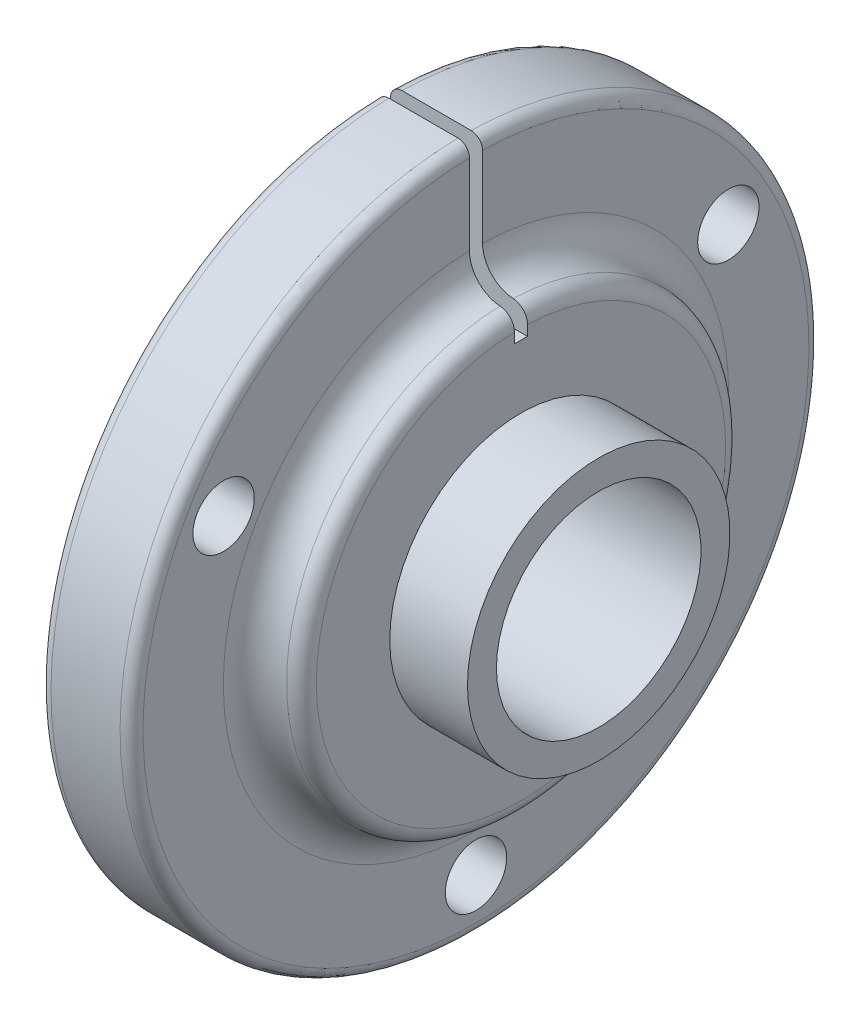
ISO-10303-21;
HEADER;
FILE_DESCRIPTION(('STEP AP214'),'2;1');
FILE_NAME('part.step','',(''),(''),'','','');
FILE_SCHEMA(('AUTOMOTIVE_DESIGN { 1 0 10303 214 1 1 1 1 }'));
ENDSEC;
DATA;
#1=APPLICATION_CONTEXT('core data for automotive mechanical design processes');
#2=APPLICATION_PROTOCOL_DEFINITION('international standard','automotive_design',2000,#1);
#3=PRODUCT_CONTEXT('',#1,'mechanical');
#4=PRODUCT('Part','Part','',(#3));
#5=PRODUCT_RELATED_PRODUCT_CATEGORY('part','',(#4));
#6=PRODUCT_DEFINITION_FORMATION('','',#4);
#7=PRODUCT_DEFINITION_CONTEXT('part definition',#1,'design');
#8=PRODUCT_DEFINITION('design','',#6,#7);
#9=PRODUCT_DEFINITION_SHAPE('','',#8);
#10=(LENGTH_UNIT() NAMED_UNIT(*) SI_UNIT(.MILLI.,.METRE.));
#11=(NAMED_UNIT(*) PLANE_ANGLE_UNIT() SI_UNIT($,.RADIAN.));
#12=(NAMED_UNIT(*) SI_UNIT($,.STERADIAN.) SOLID_ANGLE_UNIT());
#13=UNCERTAINTY_MEASURE_WITH_UNIT(LENGTH_MEASURE(1.E-05),#10,'distance_accuracy_value','');
#14=(GEOMETRIC_REPRESENTATION_CONTEXT(3) GLOBAL_UNCERTAINTY_ASSIGNED_CONTEXT((#13)) GLOBAL_UNIT_ASSIGNED_CONTEXT((#10,
#11,#12)) REPRESENTATION_CONTEXT('',''));
#15=CARTESIAN_POINT('',(0.,0.,0.));
#16=DIRECTION('',(0.,0.,1.));
#17=DIRECTION('',(1.,0.,0.));
#18=AXIS2_PLACEMENT_3D('',#15,#16,#17);
#19=CARTESIAN_POINT('',(0.,53.467,0.));
#20=DIRECTION('',(1.,0.,0.));
#21=DIRECTION('',(0.,0.,-1.));
#22=AXIS2_PLACEMENT_3D('',#19,#20,#21);
#23=PLANE('',#22);
#24=CARTESIAN_POINT('',(0.,22.6187000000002,-39.1767376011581));
#25=DIRECTION('',(1.,0.,0.));
#26=DIRECTION('',(0.,0.,-1.));
#27=AXIS2_PLACEMENT_3D('',#24,#25,#26);
#28=CIRCLE('',#27,4.7625);
#29=CARTESIAN_POINT('',(0.,22.6187000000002,-43.9392376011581));
#30=VERTEX_POINT('',#29);
#31=EDGE_CURVE('E263',#30,#30,#28,.T.);
#32=ORIENTED_EDGE('',*,*,#31,.T.);
#33=EDGE_LOOP('',(#32));
#34=FACE_BOUND('',#33,.T.);
#35=CARTESIAN_POINT('',(0.,0.,0.));
#36=DIRECTION('',(-1.,0.,0.));
#37=DIRECTION('',(0.,0.,1.));
#38=AXIS2_PLACEMENT_3D('',#35,#36,#37);
#39=CIRCLE('',#38,20.3708);
#40=CARTESIAN_POINT('',(0.,0.,20.3708));
#41=VERTEX_POINT('',#40);
#42=EDGE_CURVE('E228',#41,#41,#39,.T.);
#43=ORIENTED_EDGE('',*,*,#42,.F.);
#44=EDGE_LOOP('',(#43));
#45=FACE_BOUND('',#44,.T.);
#46=DIRECTION('',(0.,0.,1.));
#47=VECTOR('',#46,1.);
#48=CARTESIAN_POINT('',(0.,30.1625,0.));
#49=LINE('',#48,#47);
#50=CARTESIAN_POINT('',(0.,30.1625,-1.016));
#51=VERTEX_POINT('',#50);
#52=CARTESIAN_POINT('',(0.,30.1625,1.016));
#53=VERTEX_POINT('',#52);
#54=EDGE_CURVE('E110',#51,#53,#49,.T.);
#55=ORIENTED_EDGE('',*,*,#54,.F.);
#56=DIRECTION('',(0.,1.,0.));
#57=VECTOR('',#56,1.);
#58=CARTESIAN_POINT('',(0.,53.467,-1.016));
#59=LINE('',#58,#57);
#60=CARTESIAN_POINT('',(-5.10757997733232E-12,51.6790137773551,-1.016));
#61=VERTEX_POINT('',#60);
#62=EDGE_CURVE('E191',#51,#61,#59,.T.);
#63=ORIENTED_EDGE('',*,*,#62,.T.);
#64=CARTESIAN_POINT('',(0.,0.,0.));
#65=DIRECTION('',(1.,0.,0.));
#66=DIRECTION('',(0.,0.,-1.));
#67=AXIS2_PLACEMENT_3D('',#64,#65,#66);
#68=CIRCLE('',#67,51.689);
#69=CARTESIAN_POINT('',(-5.10757997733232E-12,51.6790137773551,1.016));
#70=VERTEX_POINT('',#69);
#71=EDGE_CURVE('E131',#61,#70,#68,.F.);
#72=ORIENTED_EDGE('',*,*,#71,.T.);
#73=DIRECTION('',(0.,1.,0.));
#74=VECTOR('',#73,1.);
#75=CARTESIAN_POINT('',(0.,53.467,1.016));
#76=LINE('',#75,#74);
#77=EDGE_CURVE('E122',#53,#70,#76,.T.);
#78=ORIENTED_EDGE('',*,*,#77,.F.);
#79=EDGE_LOOP('',(#55,#63,#72,#78));
#80=FACE_BOUND('',#79,.T.);
#81=CARTESIAN_POINT('',(0.,22.6187000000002,39.1767376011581));
#82=DIRECTION('',(1.,0.,0.));
#83=DIRECTION('',(0.,0.,-1.));
#84=AXIS2_PLACEMENT_3D('',#81,#82,#83);
#85=CIRCLE('',#84,4.76250000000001);
#86=CARTESIAN_POINT('',(0.,22.6187000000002,34.414237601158));
#87=VERTEX_POINT('',#86);
#88=EDGE_CURVE('E260',#87,#87,#85,.T.);
#89=ORIENTED_EDGE('',*,*,#88,.T.);
#90=EDGE_LOOP('',(#89));
#91=FACE_BOUND('',#90,.T.);
#92=CARTESIAN_POINT('',(0.,-45.2374,0.));
#93=DIRECTION('',(1.,0.,0.));
#94=DIRECTION('',(0.,0.,-1.));
#95=AXIS2_PLACEMENT_3D('',#92,#93,#94);
#96=CIRCLE('',#95,4.76250000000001);
#97=CARTESIAN_POINT('',(0.,-45.2374,-4.76250000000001));
#98=VERTEX_POINT('',#97);
#99=EDGE_CURVE('E272',#98,#98,#96,.T.);
#100=ORIENTED_EDGE('',*,*,#99,.T.);
#101=EDGE_LOOP('',(#100));
#102=FACE_BOUND('',#101,.T.);
#103=ADVANCED_FACE('F35',(#34,#45,#80,#91,#102),#23,.F.);
#104=CARTESIAN_POINT('',(14.2748,39.2176,0.));
#105=DIRECTION('',(-1.,0.,0.));
#106=DIRECTION('',(0.,0.,1.));
#107=AXIS2_PLACEMENT_3D('',#104,#105,#106);
#108=PLANE('',#107);
#109=CARTESIAN_POINT('',(14.2748,22.6187000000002,-39.1767376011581));
#110=DIRECTION('',(-1.,0.,0.));
#111=DIRECTION('',(0.,0.,1.));
#112=AXIS2_PLACEMENT_3D('',#109,#110,#111);
#113=CIRCLE('',#112,4.7625);
#114=CARTESIAN_POINT('',(14.2748,22.6187000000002,-34.4142376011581));
#115=VERTEX_POINT('',#114);
#116=EDGE_CURVE('E261',#115,#115,#113,.F.);
#117=ORIENTED_EDGE('',*,*,#116,.F.);
#118=EDGE_LOOP('',(#117));
#119=FACE_BOUND('',#118,.T.);
#120=CARTESIAN_POINT('',(14.2748,0.,0.));
#121=DIRECTION('',(-1.,0.,0.));
#122=DIRECTION('',(0.,0.,1.));
#123=AXIS2_PLACEMENT_3D('',#120,#121,#122);
#124=CIRCLE('',#123,51.689);
#125=CARTESIAN_POINT('',(14.2748,51.6790137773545,1.016));
#126=VERTEX_POINT('',#125);
#127=CARTESIAN_POINT('',(14.2748,51.6790137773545,-1.016));
#128=VERTEX_POINT('',#127);
#129=EDGE_CURVE('E246',#126,#128,#124,.F.);
#130=ORIENTED_EDGE('',*,*,#129,.T.);
#131=DIRECTION('',(0.,-1.,0.));
#132=VECTOR('',#131,1.);
#133=CARTESIAN_POINT('',(14.2748,39.2176,-1.016));
#134=LINE('',#133,#132);
#135=CARTESIAN_POINT('',(14.2748,39.2044371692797,-1.016));
#136=VERTEX_POINT('',#135);
#137=EDGE_CURVE('E281',#128,#136,#134,.T.);
#138=ORIENTED_EDGE('',*,*,#137,.T.);
#139=CARTESIAN_POINT('',(14.2748,0.,0.));
#140=DIRECTION('',(-1.,0.,0.));
#141=DIRECTION('',(0.,0.,1.));
#142=AXIS2_PLACEMENT_3D('',#139,#140,#141);
#143=CIRCLE('',#142,39.2176);
#144=CARTESIAN_POINT('',(14.2748,39.2044371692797,1.016));
#145=VERTEX_POINT('',#144);
#146=EDGE_CURVE('E234',#136,#145,#143,.T.);
#147=ORIENTED_EDGE('',*,*,#146,.T.);
#148=DIRECTION('',(0.,-1.,0.));
#149=VECTOR('',#148,1.);
#150=CARTESIAN_POINT('',(14.2748,39.2176,1.016));
#151=LINE('',#150,#149);
#152=EDGE_CURVE('E275',#126,#145,#151,.T.);
#153=ORIENTED_EDGE('',*,*,#152,.F.);
#154=EDGE_LOOP('',(#130,#138,#147,#153));
#155=FACE_BOUND('',#154,.T.);
#156=CARTESIAN_POINT('',(14.2748,22.6187000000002,39.1767376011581));
#157=DIRECTION('',(-1.,0.,0.));
#158=DIRECTION('',(0.,0.,1.));
#159=AXIS2_PLACEMENT_3D('',#156,#157,#158);
#160=CIRCLE('',#159,4.76250000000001);
#161=CARTESIAN_POINT('',(14.2748,22.6187000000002,43.9392376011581));
#162=VERTEX_POINT('',#161);
#163=EDGE_CURVE('E126',#162,#162,#160,.F.);
#164=ORIENTED_EDGE('',*,*,#163,.F.);
#165=EDGE_LOOP('',(#164));
#166=FACE_BOUND('',#165,.T.);
#167=CARTESIAN_POINT('',(14.2748,-45.2374,0.));
#168=DIRECTION('',(-1.,0.,0.));
#169=DIRECTION('',(0.,0.,1.));
#170=AXIS2_PLACEMENT_3D('',#167,#168,#169);
#171=CIRCLE('',#170,4.76250000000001);
#172=CARTESIAN_POINT('',(14.2748,-45.2374,4.76250000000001));
#173=VERTEX_POINT('',#172);
#174=EDGE_CURVE('E40',#173,#173,#171,.F.);
#175=ORIENTED_EDGE('',*,*,#174,.F.);
#176=EDGE_LOOP('',(#175));
#177=FACE_BOUND('',#176,.T.);
#178=ADVANCED_FACE('F202',(#119,#155,#166,#177),#108,.F.);
#179=CARTESIAN_POINT('',(-4.7752,20.3708,0.));
#180=DIRECTION('',(1.,0.,0.));
#181=DIRECTION('',(0.,0.,-1.));
#182=AXIS2_PLACEMENT_3D('',#179,#180,#181);
#183=PLANE('',#182);
#184=CARTESIAN_POINT('',(-4.7752,0.,0.));
#185=DIRECTION('',(-1.,0.,0.));
#186=DIRECTION('',(0.,0.,1.));
#187=AXIS2_PLACEMENT_3D('',#184,#185,#186);
#188=CIRCLE('',#187,15.875);
#189=CARTESIAN_POINT('',(-4.7752,0.,15.875));
#190=VERTEX_POINT('',#189);
#191=EDGE_CURVE('E119',#190,#190,#188,.T.);
#192=ORIENTED_EDGE('',*,*,#191,.F.);
#193=EDGE_LOOP('',(#192));
#194=FACE_BOUND('',#193,.T.);
#195=CARTESIAN_POINT('',(-4.7752,0.,0.));
#196=DIRECTION('',(-1.,0.,0.));
#197=DIRECTION('',(0.,0.,1.));
#198=AXIS2_PLACEMENT_3D('',#195,#196,#197);
#199=CIRCLE('',#198,20.3708);
#200=CARTESIAN_POINT('',(-4.7752,0.,20.3708));
#201=VERTEX_POINT('',#200);
#202=EDGE_CURVE('E226',#201,#201,#199,.T.);
#203=ORIENTED_EDGE('',*,*,#202,.T.);
#204=EDGE_LOOP('',(#203));
#205=FACE_BOUND('',#204,.T.);
#206=ADVANCED_FACE('F206',(#194,#205),#183,.F.);
#207=CARTESIAN_POINT('',(0.,0.,0.));
#208=DIRECTION('',(-1.,0.,0.));
#209=DIRECTION('',(0.,0.,1.));
#210=AXIS2_PLACEMENT_3D('',#207,#208,#209);
#211=CYLINDRICAL_SURFACE('',#210,20.3708);
#212=ORIENTED_EDGE('',*,*,#202,.F.);
#213=EDGE_LOOP('',(#212));
#214=FACE_BOUND('',#213,.T.);
#215=ORIENTED_EDGE('',*,*,#42,.T.);
#216=EDGE_LOOP('',(#215));
#217=FACE_BOUND('',#216,.T.);
#218=ADVANCED_FACE('F210',(#214,#217),#211,.T.);
#219=CARTESIAN_POINT('',(0.,0.,0.));
#220=DIRECTION('',(-1.,0.,0.));
#221=DIRECTION('',(0.,0.,1.));
#222=AXIS2_PLACEMENT_3D('',#219,#220,#221);
#223=CYLINDRICAL_SURFACE('',#222,53.467);
#224=CARTESIAN_POINT('',(1.778,0.,0.));
#225=DIRECTION('',(1.,0.,0.));
#226=DIRECTION('',(0.,0.,-1.));
#227=AXIS2_PLACEMENT_3D('',#224,#225,#226);
#228=CIRCLE('',#227,53.467);
#229=CARTESIAN_POINT('',(1.778,53.4573459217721,1.016));
#230=VERTEX_POINT('',#229);
#231=CARTESIAN_POINT('',(1.778,53.4573459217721,-1.016));
#232=VERTEX_POINT('',#231);
#233=EDGE_CURVE('E244',#230,#232,#228,.T.);
#234=ORIENTED_EDGE('',*,*,#233,.T.);
#235=DIRECTION('',(-1.,0.,0.));
#236=VECTOR('',#235,1.);
#237=CARTESIAN_POINT('',(0.,53.4573459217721,-1.016));
#238=LINE('',#237,#236);
#239=CARTESIAN_POINT('',(12.4968,53.4573459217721,-1.016));
#240=VERTEX_POINT('',#239);
#241=EDGE_CURVE('E186',#232,#240,#238,.F.);
#242=ORIENTED_EDGE('',*,*,#241,.T.);
#243=CARTESIAN_POINT('',(12.4968,0.,0.));
#244=DIRECTION('',(-1.,0.,0.));
#245=DIRECTION('',(0.,0.,1.));
#246=AXIS2_PLACEMENT_3D('',#243,#244,#245);
#247=CIRCLE('',#246,53.467);
#248=CARTESIAN_POINT('',(12.4968,53.4573459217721,1.016));
#249=VERTEX_POINT('',#248);
#250=EDGE_CURVE('E241',#240,#249,#247,.T.);
#251=ORIENTED_EDGE('',*,*,#250,.T.);
#252=DIRECTION('',(-1.,0.,0.));
#253=VECTOR('',#252,1.);
#254=CARTESIAN_POINT('',(0.,53.4573459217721,1.016));
#255=LINE('',#254,#253);
#256=EDGE_CURVE('E53',#230,#249,#255,.F.);
#257=ORIENTED_EDGE('',*,*,#256,.F.);
#258=EDGE_LOOP('',(#234,#242,#251,#257));
#259=FACE_BOUND('',#258,.T.);
#260=ADVANCED_FACE('F199',(#259),#223,.T.);
#261=CARTESIAN_POINT('',(19.3548,0.,0.));
#262=DIRECTION('',(-1.,0.,0.));
#263=DIRECTION('',(0.,0.,1.));
#264=AXIS2_PLACEMENT_3D('',#261,#262,#263);
#265=TOROIDAL_SURFACE('',#264,39.2176,5.08);
#266=ORIENTED_EDGE('',*,*,#146,.F.);
#267=CARTESIAN_POINT('',(18.0370004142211,34.2964556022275,-1.016));
#268=CARTESIAN_POINT('',(18.1747783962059,34.2594305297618,-1.016));
#269=CARTESIAN_POINT('',(18.3141014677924,34.2282202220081,-1.016));
#270=CARTESIAN_POINT('',(18.5949259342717,34.177629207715,-1.016));
#271=CARTESIAN_POINT('',(18.7364278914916,34.158251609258,-1.016));
#272=CARTESIAN_POINT('',(19.0206850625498,34.1314691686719,-1.016));
#273=CARTESIAN_POINT('',(19.1634412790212,34.1240749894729,-1.016));
#274=CARTESIAN_POINT('',(19.4491218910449,34.1213438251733,-1.016));
#275=CARTESIAN_POINT('',(19.5920463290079,34.1260112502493,-1.016));
#276=CARTESIAN_POINT('',(19.8768720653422,34.1473705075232,-1.016));
#277=CARTESIAN_POINT('',(20.018774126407,34.1640521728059,-1.016));
#278=CARTESIAN_POINT('',(20.3007207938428,34.2093179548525,-1.016));
#279=CARTESIAN_POINT('',(20.440764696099,34.2379064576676,-1.016));
#280=CARTESIAN_POINT('',(20.7178598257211,34.3067611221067,-1.016));
#281=CARTESIAN_POINT('',(20.8549128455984,34.3470200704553,-1.016));
#282=CARTESIAN_POINT('',(21.1251920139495,34.4389526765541,-1.016));
#283=CARTESIAN_POINT('',(21.2584167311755,34.4906305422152,-1.016));
#284=CARTESIAN_POINT('',(21.5200122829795,34.6050121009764,-1.016));
#285=CARTESIAN_POINT('',(21.6483841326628,34.6677134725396,-1.016));
#286=CARTESIAN_POINT('',(21.8994385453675,34.8037281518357,-1.016));
#287=CARTESIAN_POINT('',(22.0221189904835,34.8770453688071,-1.016));
#288=CARTESIAN_POINT('',(22.2608293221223,35.0337265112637,-1.016));
#289=CARTESIAN_POINT('',(22.3768613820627,35.1170871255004,-1.016));
#290=CARTESIAN_POINT('',(22.6015368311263,35.2933135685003,-1.016));
#291=CARTESIAN_POINT('',(22.7101774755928,35.3861828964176,-1.016));
#292=CARTESIAN_POINT('',(22.9192462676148,35.5807357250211,-1.016));
#293=CARTESIAN_POINT('',(23.0196748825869,35.6824187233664,-1.016));
#294=CARTESIAN_POINT('',(23.2116485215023,35.8939159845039,-1.016));
#295=CARTESIAN_POINT('',(23.3031902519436,36.0037332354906,-1.016));
#296=CARTESIAN_POINT('',(23.4766701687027,36.2306557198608,-1.016));
#297=CARTESIAN_POINT('',(23.5586118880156,36.3477582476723,-1.016));
#298=CARTESIAN_POINT('',(23.7123639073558,36.5884519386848,-1.016));
#299=CARTESIAN_POINT('',(23.784170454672,36.7120454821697,-1.016));
#300=CARTESIAN_POINT('',(23.9835667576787,37.091282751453,-1.016));
#301=CARTESIAN_POINT('',(24.0952510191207,37.3555375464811,-1.016));
#302=CARTESIAN_POINT('',(24.2726148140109,37.8989019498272,-1.016));
#303=CARTESIAN_POINT('',(24.338294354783,38.1780115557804,-1.016));
#304=CARTESIAN_POINT('',(24.4219069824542,38.7434064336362,-1.016));
#305=CARTESIAN_POINT('',(24.4398276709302,39.0296935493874,-1.016));
#306=CARTESIAN_POINT('',(24.4273477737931,39.60120348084,-1.016));
#307=CARTESIAN_POINT('',(24.3969471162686,39.886426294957,-1.016));
#308=CARTESIAN_POINT('',(24.2886902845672,40.4477287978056,-1.016));
#309=CARTESIAN_POINT('',(24.2108329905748,40.7238082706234,-1.016));
#310=CARTESIAN_POINT('',(24.0098651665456,41.2589730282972,-1.016));
#311=CARTESIAN_POINT('',(23.8867546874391,41.5180583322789,-1.016));
#312=CARTESIAN_POINT('',(23.5987973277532,42.0118304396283,-1.016));
#313=CARTESIAN_POINT('',(23.4339578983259,42.2465215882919,-1.016));
#314=CARTESIAN_POINT('',(23.0672071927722,42.6848887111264,-1.016));
#315=CARTESIAN_POINT('',(22.8652959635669,42.8885647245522,-1.016));
#316=CARTESIAN_POINT('',(22.4301933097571,43.2590594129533,-1.016));
#317=CARTESIAN_POINT('',(22.1970105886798,43.4258883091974,-1.016));
#318=CARTESIAN_POINT('',(21.7059406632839,43.7180179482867,-1.016));
#319=CARTESIAN_POINT('',(21.4480534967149,43.8433187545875,-1.016));
#320=CARTESIAN_POINT('',(20.9149687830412,44.0488016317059,-1.016));
#321=CARTESIAN_POINT('',(20.6397758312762,44.1289956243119,-1.016));
#322=CARTESIAN_POINT('',(20.0798315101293,44.2420358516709,-1.016));
#323=CARTESIAN_POINT('',(19.7950801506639,44.2748821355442,-1.016));
#324=CARTESIAN_POINT('',(19.2241525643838,44.2922915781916,-1.016));
#325=CARTESIAN_POINT('',(18.9379765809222,44.2768627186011,-1.016));
#326=CARTESIAN_POINT('',(18.3722771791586,44.1981779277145,-1.016));
#327=CARTESIAN_POINT('',(18.0927537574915,44.134922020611,-1.016));
#328=CARTESIAN_POINT('',(17.5482992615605,43.9623832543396,-1.016));
#329=CARTESIAN_POINT('',(17.2833678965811,43.8531013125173,-1.016));
#330=CARTESIAN_POINT('',(16.7756088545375,43.5916151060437,-1.016));
#331=CARTESIAN_POINT('',(16.5327811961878,43.4394108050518,-1.016));
#332=CARTESIAN_POINT('',(16.076087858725,43.0963848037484,-1.016));
#333=CARTESIAN_POINT('',(15.8622259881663,42.9055580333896,-1.016));
#334=CARTESIAN_POINT('',(15.4695640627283,42.4907056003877,-1.016));
#335=CARTESIAN_POINT('',(15.2907640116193,42.2666799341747,-1.016));
#336=CARTESIAN_POINT('',(14.9732614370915,41.7917832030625,-1.016));
#337=CARTESIAN_POINT('',(14.8345687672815,41.5409055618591,-1.016));
#338=CARTESIAN_POINT('',(14.601238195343,41.0192755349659,-1.016));
#339=CARTESIAN_POINT('',(14.5066004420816,40.7485230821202,-1.016));
#340=CARTESIAN_POINT('',(14.399731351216,40.3336105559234,-1.016));
#341=CARTESIAN_POINT('',(14.3699479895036,40.1937447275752,-1.016));
#342=CARTESIAN_POINT('',(14.3222637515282,39.9120162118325,-1.016));
#343=CARTESIAN_POINT('',(14.3043584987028,39.7701542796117,-1.016));
#344=CARTESIAN_POINT('',(14.2805569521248,39.4853833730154,-1.016));
#345=CARTESIAN_POINT('',(14.2746651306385,39.3424740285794,-1.016));
#346=CARTESIAN_POINT('',(14.2749394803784,39.0567171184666,-1.016));
#347=CARTESIAN_POINT('',(14.2811012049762,38.913869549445,-1.016));
#348=CARTESIAN_POINT('',(14.3054387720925,38.6291152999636,-1.016));
#349=CARTESIAN_POINT('',(14.3236218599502,38.4872092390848,-1.016));
#350=CARTESIAN_POINT('',(14.3718706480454,38.2054855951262,-1.016));
#351=CARTESIAN_POINT('',(14.401931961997,38.065667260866,-1.016));
#352=CARTESIAN_POINT('',(14.4737358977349,37.7890135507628,-1.016));
#353=CARTESIAN_POINT('',(14.5154823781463,37.6521791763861,-1.016));
#354=CARTESIAN_POINT('',(14.610338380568,37.3825641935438,-1.016));
#355=CARTESIAN_POINT('',(14.6634437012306,37.2497821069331,-1.016));
#356=CARTESIAN_POINT('',(14.7806672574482,36.9891235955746,-1.016));
#357=CARTESIAN_POINT('',(14.8447887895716,36.8612486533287,-1.016));
#358=CARTESIAN_POINT('',(14.9835527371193,36.6114024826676,-1.016));
#359=CARTESIAN_POINT('',(15.0581912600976,36.489429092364,-1.016));
#360=CARTESIAN_POINT('',(15.2175266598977,36.2521294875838,-1.016));
#361=CARTESIAN_POINT('',(15.3022297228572,36.1368074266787,-1.016));
#362=CARTESIAN_POINT('',(15.4810221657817,35.9137548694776,-1.016));
#363=CARTESIAN_POINT('',(15.5751080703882,35.8060215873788,-1.016));
#364=CARTESIAN_POINT('',(15.7720875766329,35.5988000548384,-1.016));
#365=CARTESIAN_POINT('',(15.8749868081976,35.4993171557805,-1.016));
#366=CARTESIAN_POINT('',(16.0887686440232,35.3094185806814,-1.016));
#367=CARTESIAN_POINT('',(16.1996483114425,35.2189995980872,-1.016));
#368=CARTESIAN_POINT('',(16.428536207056,35.0479075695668,-1.016));
#369=CARTESIAN_POINT('',(16.5465379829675,34.9672258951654,-1.016));
#370=CARTESIAN_POINT('',(16.7888786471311,34.8161134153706,-1.016));
#371=CARTESIAN_POINT('',(16.9132158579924,34.7456799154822,-1.016));
#372=CARTESIAN_POINT('',(17.1990537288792,34.5993237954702,-1.016));
#373=CARTESIAN_POINT('',(17.3621003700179,34.5263997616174,-1.016));
#374=CARTESIAN_POINT('',(17.6949600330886,34.3981069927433,-1.016));
#375=CARTESIAN_POINT('',(17.864773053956,34.34273825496,-1.016));
#376=CARTESIAN_POINT('',(18.0370004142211,34.2964556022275,-1.016));
#377=B_SPLINE_CURVE_WITH_KNOTS('',3,(#267,#268,#269,#270,#271,#272,#273,#274,#275,#276,#277,
#278,#279,#280,#281,#282,#283,#284,#285,#286,#287,#288,#289,#290,#291,#292,#293,#294,#295,#296,
#297,#298,#299,#300,#301,#302,#303,#304,#305,#306,#307,#308,#309,#310,#311,#312,#313,#314,#315,
#316,#317,#318,#319,#320,#321,#322,#323,#324,#325,#326,#327,#328,#329,#330,#331,#332,#333,#334,
#335,#336,#337,#338,#339,#340,#341,#342,#343,#344,#345,#346,#347,#348,#349,#350,#351,#352,#353,
#354,#355,#356,#357,#358,#359,#360,#361,#362,#363,#364,#365,#366,#367,#368,#369,#370,#371,#372,
#373,#374,#375,#376),.UNSPECIFIED.,.T.,.F.,(4,2,2,2,2,2,2,2,2,2,2,2,2,2,2,2,2,2,2,2,2,2,2,2,2,2,
2,2,2,2,2,2,2,2,2,2,2,2,2,2,2,2,2,2,2,2,2,2,2,2,2,2,2,2,4),(0.,0.427842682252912,
0.855797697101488,1.28413330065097,1.71262554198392,2.14075560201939,2.56904350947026,
2.99706726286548,3.42524900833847,3.85334068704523,4.28159041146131,4.70969932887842,
5.13796635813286,5.56620899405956,5.99460973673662,6.42285232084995,6.85125305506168,
7.70747909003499,8.5637049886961,9.42015314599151,10.2766025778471,11.1330722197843,
11.9895408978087,12.8458567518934,13.7021715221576,14.5582484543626,15.4143240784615,
16.2701733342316,17.1260217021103,17.9817285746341,18.8374350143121,19.6931243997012,
20.5488145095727,21.4046170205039,22.2604196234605,23.1164323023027,23.9724478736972,
24.4010364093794,24.8294669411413,25.2580569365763,25.6864888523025,26.115179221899,
26.5437114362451,26.9723853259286,27.4009009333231,27.8295449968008,28.2580308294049,
28.68678140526,29.1153737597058,29.5442419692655,29.9729531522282,30.4012816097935,
30.8294972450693,31.364315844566,31.8991343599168),.UNSPECIFIED.);
#378=CARTESIAN_POINT('',(19.0265006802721,34.1331017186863,-1.016));
#379=VERTEX_POINT('',#378);
#380=EDGE_CURVE('E185',#136,#379,#377,.T.);
#381=ORIENTED_EDGE('',*,*,#380,.T.);
#382=CARTESIAN_POINT('',(19.0265006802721,0.,0.));
#383=DIRECTION('',(1.,0.,0.));
#384=DIRECTION('',(0.,0.,-1.));
#385=AXIS2_PLACEMENT_3D('',#382,#383,#384);
#386=CIRCLE('',#385,34.1482194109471);
#387=CARTESIAN_POINT('',(19.0265006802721,34.1331017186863,1.016));
#388=VERTEX_POINT('',#387);
#389=EDGE_CURVE('E227',#379,#388,#386,.F.);
#390=ORIENTED_EDGE('',*,*,#389,.T.);
#391=CARTESIAN_POINT('',(18.0370004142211,34.2964556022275,1.016));
#392=CARTESIAN_POINT('',(18.1747783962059,34.2594305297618,1.016));
#393=CARTESIAN_POINT('',(18.3141014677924,34.2282202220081,1.016));
#394=CARTESIAN_POINT('',(18.5949259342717,34.177629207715,1.016));
#395=CARTESIAN_POINT('',(18.7364278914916,34.158251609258,1.016));
#396=CARTESIAN_POINT('',(19.0206850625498,34.1314691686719,1.016));
#397=CARTESIAN_POINT('',(19.1634412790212,34.1240749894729,1.016));
#398=CARTESIAN_POINT('',(19.4491218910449,34.1213438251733,1.016));
#399=CARTESIAN_POINT('',(19.5920463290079,34.1260112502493,1.016));
#400=CARTESIAN_POINT('',(19.8768720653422,34.1473705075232,1.016));
#401=CARTESIAN_POINT('',(20.018774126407,34.1640521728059,1.016));
#402=CARTESIAN_POINT('',(20.3007207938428,34.2093179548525,1.016));
#403=CARTESIAN_POINT('',(20.440764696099,34.2379064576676,1.016));
#404=CARTESIAN_POINT('',(20.7178598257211,34.3067611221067,1.016));
#405=CARTESIAN_POINT('',(20.8549128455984,34.3470200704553,1.016));
#406=CARTESIAN_POINT('',(21.1251920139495,34.4389526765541,1.016));
#407=CARTESIAN_POINT('',(21.2584167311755,34.4906305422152,1.016));
#408=CARTESIAN_POINT('',(21.5200122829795,34.6050121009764,1.016));
#409=CARTESIAN_POINT('',(21.6483841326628,34.6677134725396,1.016));
#410=CARTESIAN_POINT('',(21.8994385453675,34.8037281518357,1.016));
#411=CARTESIAN_POINT('',(22.0221189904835,34.8770453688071,1.016));
#412=CARTESIAN_POINT('',(22.2608293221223,35.0337265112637,1.016));
#413=CARTESIAN_POINT('',(22.3768613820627,35.1170871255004,1.016));
#414=CARTESIAN_POINT('',(22.6015368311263,35.2933135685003,1.016));
#415=CARTESIAN_POINT('',(22.7101774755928,35.3861828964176,1.016));
#416=CARTESIAN_POINT('',(22.9192462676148,35.5807357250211,1.016));
#417=CARTESIAN_POINT('',(23.0196748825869,35.6824187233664,1.016));
#418=CARTESIAN_POINT('',(23.2116485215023,35.8939159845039,1.016));
#419=CARTESIAN_POINT('',(23.3031902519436,36.0037332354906,1.016));
#420=CARTESIAN_POINT('',(23.4766701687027,36.2306557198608,1.016));
#421=CARTESIAN_POINT('',(23.5586118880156,36.3477582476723,1.016));
#422=CARTESIAN_POINT('',(23.7123639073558,36.5884519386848,1.016));
#423=CARTESIAN_POINT('',(23.784170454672,36.7120454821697,1.016));
#424=CARTESIAN_POINT('',(23.9835667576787,37.091282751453,1.016));
#425=CARTESIAN_POINT('',(24.0952510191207,37.3555375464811,1.016));
#426=CARTESIAN_POINT('',(24.2726148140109,37.8989019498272,1.016));
#427=CARTESIAN_POINT('',(24.338294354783,38.1780115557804,1.016));
#428=CARTESIAN_POINT('',(24.4219069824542,38.7434064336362,1.016));
#429=CARTESIAN_POINT('',(24.4398276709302,39.0296935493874,1.016));
#430=CARTESIAN_POINT('',(24.4273477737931,39.60120348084,1.016));
#431=CARTESIAN_POINT('',(24.3969471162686,39.886426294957,1.016));
#432=CARTESIAN_POINT('',(24.2886902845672,40.4477287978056,1.016));
#433=CARTESIAN_POINT('',(24.2108329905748,40.7238082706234,1.016));
#434=CARTESIAN_POINT('',(24.0098651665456,41.2589730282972,1.016));
#435=CARTESIAN_POINT('',(23.8867546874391,41.5180583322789,1.016));
#436=CARTESIAN_POINT('',(23.5987973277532,42.0118304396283,1.016));
#437=CARTESIAN_POINT('',(23.4339578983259,42.2465215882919,1.016));
#438=CARTESIAN_POINT('',(23.0672071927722,42.6848887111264,1.016));
#439=CARTESIAN_POINT('',(22.8652959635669,42.8885647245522,1.016));
#440=CARTESIAN_POINT('',(22.4301933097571,43.2590594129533,1.016));
#441=CARTESIAN_POINT('',(22.1970105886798,43.4258883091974,1.016));
#442=CARTESIAN_POINT('',(21.7059406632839,43.7180179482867,1.016));
#443=CARTESIAN_POINT('',(21.4480534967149,43.8433187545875,1.016));
#444=CARTESIAN_POINT('',(20.9149687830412,44.0488016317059,1.016));
#445=CARTESIAN_POINT('',(20.6397758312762,44.1289956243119,1.016));
#446=CARTESIAN_POINT('',(20.0798315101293,44.2420358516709,1.016));
#447=CARTESIAN_POINT('',(19.7950801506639,44.2748821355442,1.016));
#448=CARTESIAN_POINT('',(19.2241525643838,44.2922915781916,1.016));
#449=CARTESIAN_POINT('',(18.9379765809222,44.2768627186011,1.016));
#450=CARTESIAN_POINT('',(18.3722771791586,44.1981779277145,1.016));
#451=CARTESIAN_POINT('',(18.0927537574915,44.134922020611,1.016));
#452=CARTESIAN_POINT('',(17.5482992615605,43.9623832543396,1.016));
#453=CARTESIAN_POINT('',(17.2833678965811,43.8531013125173,1.016));
#454=CARTESIAN_POINT('',(16.7756088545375,43.5916151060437,1.016));
#455=CARTESIAN_POINT('',(16.5327811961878,43.4394108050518,1.016));
#456=CARTESIAN_POINT('',(16.076087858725,43.0963848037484,1.016));
#457=CARTESIAN_POINT('',(15.8622259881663,42.9055580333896,1.016));
#458=CARTESIAN_POINT('',(15.4695640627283,42.4907056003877,1.016));
#459=CARTESIAN_POINT('',(15.2907640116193,42.2666799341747,1.016));
#460=CARTESIAN_POINT('',(14.9732614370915,41.7917832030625,1.016));
#461=CARTESIAN_POINT('',(14.8345687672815,41.5409055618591,1.016));
#462=CARTESIAN_POINT('',(14.601238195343,41.0192755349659,1.016));
#463=CARTESIAN_POINT('',(14.5066004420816,40.7485230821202,1.016));
#464=CARTESIAN_POINT('',(14.399731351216,40.3336105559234,1.016));
#465=CARTESIAN_POINT('',(14.3699479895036,40.1937447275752,1.016));
#466=CARTESIAN_POINT('',(14.3222637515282,39.9120162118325,1.016));
#467=CARTESIAN_POINT('',(14.3043584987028,39.7701542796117,1.016));
#468=CARTESIAN_POINT('',(14.2805569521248,39.4853833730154,1.016));
#469=CARTESIAN_POINT('',(14.2746651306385,39.3424740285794,1.016));
#470=CARTESIAN_POINT('',(14.2749394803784,39.0567171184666,1.016));
#471=CARTESIAN_POINT('',(14.2811012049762,38.913869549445,1.016));
#472=CARTESIAN_POINT('',(14.3054387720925,38.6291152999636,1.016));
#473=CARTESIAN_POINT('',(14.3236218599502,38.4872092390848,1.016));
#474=CARTESIAN_POINT('',(14.3718706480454,38.2054855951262,1.016));
#475=CARTESIAN_POINT('',(14.401931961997,38.065667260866,1.016));
#476=CARTESIAN_POINT('',(14.4737358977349,37.7890135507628,1.016));
#477=CARTESIAN_POINT('',(14.5154823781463,37.6521791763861,1.016));
#478=CARTESIAN_POINT('',(14.610338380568,37.3825641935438,1.016));
#479=CARTESIAN_POINT('',(14.6634437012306,37.2497821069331,1.016));
#480=CARTESIAN_POINT('',(14.7806672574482,36.9891235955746,1.016));
#481=CARTESIAN_POINT('',(14.8447887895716,36.8612486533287,1.016));
#482=CARTESIAN_POINT('',(14.9835527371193,36.6114024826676,1.016));
#483=CARTESIAN_POINT('',(15.0581912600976,36.489429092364,1.016));
#484=CARTESIAN_POINT('',(15.2175266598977,36.2521294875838,1.016));
#485=CARTESIAN_POINT('',(15.3022297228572,36.1368074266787,1.016));
#486=CARTESIAN_POINT('',(15.4810221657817,35.9137548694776,1.016));
#487=CARTESIAN_POINT('',(15.5751080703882,35.8060215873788,1.016));
#488=CARTESIAN_POINT('',(15.7720875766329,35.5988000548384,1.016));
#489=CARTESIAN_POINT('',(15.8749868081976,35.4993171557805,1.016));
#490=CARTESIAN_POINT('',(16.0887686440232,35.3094185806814,1.016));
#491=CARTESIAN_POINT('',(16.1996483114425,35.2189995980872,1.016));
#492=CARTESIAN_POINT('',(16.428536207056,35.0479075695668,1.016));
#493=CARTESIAN_POINT('',(16.5465379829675,34.9672258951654,1.016));
#494=CARTESIAN_POINT('',(16.7888786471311,34.8161134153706,1.016));
#495=CARTESIAN_POINT('',(16.9132158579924,34.7456799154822,1.016));
#496=CARTESIAN_POINT('',(17.1990537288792,34.5993237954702,1.016));
#497=CARTESIAN_POINT('',(17.3621003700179,34.5263997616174,1.016));
#498=CARTESIAN_POINT('',(17.6949600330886,34.3981069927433,1.016));
#499=CARTESIAN_POINT('',(17.864773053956,34.34273825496,1.016));
#500=CARTESIAN_POINT('',(18.0370004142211,34.2964556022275,1.016));
#501=B_SPLINE_CURVE_WITH_KNOTS('',3,(#391,#392,#393,#394,#395,#396,#397,#398,#399,#400,#401,
#402,#403,#404,#405,#406,#407,#408,#409,#410,#411,#412,#413,#414,#415,#416,#417,#418,#419,#420,
#421,#422,#423,#424,#425,#426,#427,#428,#429,#430,#431,#432,#433,#434,#435,#436,#437,#438,#439,
#440,#441,#442,#443,#444,#445,#446,#447,#448,#449,#450,#451,#452,#453,#454,#455,#456,#457,#458,
#459,#460,#461,#462,#463,#464,#465,#466,#467,#468,#469,#470,#471,#472,#473,#474,#475,#476,#477,
#478,#479,#480,#481,#482,#483,#484,#485,#486,#487,#488,#489,#490,#491,#492,#493,#494,#495,#496,
#497,#498,#499,#500),.UNSPECIFIED.,.T.,.F.,(4,2,2,2,2,2,2,2,2,2,2,2,2,2,2,2,2,2,2,2,2,2,2,2,2,2,
2,2,2,2,2,2,2,2,2,2,2,2,2,2,2,2,2,2,2,2,2,2,2,2,2,2,2,2,4),(0.,0.427842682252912,
0.855797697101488,1.28413330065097,1.71262554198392,2.14075560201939,2.56904350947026,
2.99706726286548,3.42524900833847,3.85334068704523,4.28159041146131,4.70969932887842,
5.13796635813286,5.56620899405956,5.99460973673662,6.42285232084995,6.85125305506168,
7.70747909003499,8.5637049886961,9.42015314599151,10.2766025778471,11.1330722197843,
11.9895408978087,12.8458567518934,13.7021715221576,14.5582484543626,15.4143240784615,
16.2701733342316,17.1260217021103,17.9817285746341,18.8374350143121,19.6931243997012,
20.5488145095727,21.4046170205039,22.2604196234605,23.1164323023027,23.9724478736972,
24.4010364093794,24.8294669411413,25.2580569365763,25.6864888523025,26.115179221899,
26.5437114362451,26.9723853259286,27.4009009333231,27.8295449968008,28.2580308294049,
28.68678140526,29.1153737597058,29.5442419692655,29.9729531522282,30.4012816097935,
30.8294972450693,31.364315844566,31.8991343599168),.UNSPECIFIED.);
#502=EDGE_CURVE('E133',#145,#388,#501,.T.);
#503=ORIENTED_EDGE('',*,*,#502,.F.);
#504=EDGE_LOOP('',(#266,#381,#390,#503));
#505=FACE_BOUND('',#504,.T.);
#506=ADVANCED_FACE('F193',(#505),#265,.F.);
#507=CARTESIAN_POINT('',(21.2598,20.3708,0.));
#508=DIRECTION('',(-1.,0.,0.));
#509=DIRECTION('',(0.,0.,1.));
#510=AXIS2_PLACEMENT_3D('',#507,#508,#509);
#511=PLANE('',#510);
#512=CARTESIAN_POINT('',(21.2598,0.,0.));
#513=DIRECTION('',(-1.,0.,0.));
#514=DIRECTION('',(0.,0.,1.));
#515=AXIS2_PLACEMENT_3D('',#512,#513,#514);
#516=CIRCLE('',#515,31.7656105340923);
#517=CARTESIAN_POINT('',(21.2598,31.7493583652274,1.016));
#518=VERTEX_POINT('',#517);
#519=CARTESIAN_POINT('',(21.2598,31.7493583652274,-1.016));
#520=VERTEX_POINT('',#519);
#521=EDGE_CURVE('E231',#518,#520,#516,.F.);
#522=ORIENTED_EDGE('',*,*,#521,.T.);
#523=DIRECTION('',(0.,-1.,0.));
#524=VECTOR('',#523,1.);
#525=CARTESIAN_POINT('',(21.2598,20.3708,-1.016));
#526=LINE('',#525,#524);
#527=CARTESIAN_POINT('',(21.2598,30.1625,-1.016));
#528=VERTEX_POINT('',#527);
#529=EDGE_CURVE('E61',#520,#528,#526,.T.);
#530=ORIENTED_EDGE('',*,*,#529,.T.);
#531=DIRECTION('',(0.,0.,-1.));
#532=VECTOR('',#531,1.);
#533=CARTESIAN_POINT('',(21.2598,30.1625,0.));
#534=LINE('',#533,#532);
#535=CARTESIAN_POINT('',(21.2598,30.1625,1.016));
#536=VERTEX_POINT('',#535);
#537=EDGE_CURVE('E11',#536,#528,#534,.T.);
#538=ORIENTED_EDGE('',*,*,#537,.F.);
#539=DIRECTION('',(0.,-1.,0.));
#540=VECTOR('',#539,1.);
#541=CARTESIAN_POINT('',(21.2598,20.3708,1.016));
#542=LINE('',#541,#540);
#543=EDGE_CURVE('E125',#518,#536,#542,.T.);
#544=ORIENTED_EDGE('',*,*,#543,.F.);
#545=EDGE_LOOP('',(#522,#530,#538,#544));
#546=FACE_BOUND('',#545,.T.);
#547=CARTESIAN_POINT('',(21.2598,0.,0.));
#548=DIRECTION('',(-1.,0.,0.));
#549=DIRECTION('',(0.,0.,1.));
#550=AXIS2_PLACEMENT_3D('',#547,#548,#549);
#551=CIRCLE('',#550,20.3708);
#552=CARTESIAN_POINT('',(21.2598,0.,20.3708));
#553=VERTEX_POINT('',#552);
#554=EDGE_CURVE('E282',#553,#553,#551,.T.);
#555=ORIENTED_EDGE('',*,*,#554,.T.);
#556=EDGE_LOOP('',(#555));
#557=FACE_BOUND('',#556,.T.);
#558=ADVANCED_FACE('F198',(#546,#557),#511,.F.);
#559=CARTESIAN_POINT('',(0.,0.,0.));
#560=DIRECTION('',(-1.,0.,0.));
#561=DIRECTION('',(0.,0.,1.));
#562=AXIS2_PLACEMENT_3D('',#559,#560,#561);
#563=CYLINDRICAL_SURFACE('',#562,20.3708);
#564=ORIENTED_EDGE('',*,*,#554,.F.);
#565=EDGE_LOOP('',(#564));
#566=FACE_BOUND('',#565,.T.);
#567=CARTESIAN_POINT('',(33.3248,0.,0.));
#568=DIRECTION('',(-1.,0.,0.));
#569=DIRECTION('',(0.,0.,1.));
#570=AXIS2_PLACEMENT_3D('',#567,#568,#569);
#571=CIRCLE('',#570,20.3708);
#572=CARTESIAN_POINT('',(33.3248,0.,20.3708));
#573=VERTEX_POINT('',#572);
#574=EDGE_CURVE('E284',#573,#573,#571,.T.);
#575=ORIENTED_EDGE('',*,*,#574,.T.);
#576=EDGE_LOOP('',(#575));
#577=FACE_BOUND('',#576,.T.);
#578=ADVANCED_FACE('F392',(#566,#577),#563,.T.);
#579=CARTESIAN_POINT('',(33.3248,15.875,0.));
#580=DIRECTION('',(-1.,0.,0.));
#581=DIRECTION('',(0.,0.,1.));
#582=AXIS2_PLACEMENT_3D('',#579,#580,#581);
#583=PLANE('',#582);
#584=ORIENTED_EDGE('',*,*,#574,.F.);
#585=EDGE_LOOP('',(#584));
#586=FACE_BOUND('',#585,.T.);
#587=CARTESIAN_POINT('',(33.3248,0.,0.));
#588=DIRECTION('',(-1.,0.,0.));
#589=DIRECTION('',(0.,0.,1.));
#590=AXIS2_PLACEMENT_3D('',#587,#588,#589);
#591=CIRCLE('',#590,15.875);
#592=CARTESIAN_POINT('',(33.3248,0.,15.875));
#593=VERTEX_POINT('',#592);
#594=EDGE_CURVE('E289',#593,#593,#591,.T.);
#595=ORIENTED_EDGE('',*,*,#594,.T.);
#596=EDGE_LOOP('',(#595));
#597=FACE_BOUND('',#596,.T.);
#598=ADVANCED_FACE('F383',(#586,#597),#583,.F.);
#599=CARTESIAN_POINT('',(0.,0.,0.));
#600=DIRECTION('',(-1.,0.,0.));
#601=DIRECTION('',(0.,0.,1.));
#602=AXIS2_PLACEMENT_3D('',#599,#600,#601);
#603=CYLINDRICAL_SURFACE('',#602,15.875);
#604=ORIENTED_EDGE('',*,*,#594,.F.);
#605=EDGE_LOOP('',(#604));
#606=FACE_BOUND('',#605,.T.);
#607=ORIENTED_EDGE('',*,*,#191,.T.);
#608=EDGE_LOOP('',(#607));
#609=FACE_BOUND('',#608,.T.);
#610=ADVANCED_FACE('F374',(#606,#609),#603,.F.);
#611=CARTESIAN_POINT('',(18.8722,0.,0.));
#612=DIRECTION('',(1.,0.,0.));
#613=DIRECTION('',(0.,0.,-1.));
#614=AXIS2_PLACEMENT_3D('',#611,#612,#613);
#615=TOROIDAL_SURFACE('',#614,31.7656105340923,2.3876);
#616=CARTESIAN_POINT('',(20.9242995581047,30.5282492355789,-1.016));
#617=CARTESIAN_POINT('',(20.992883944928,30.6436436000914,-1.016));
#618=CARTESIAN_POINT('',(21.0517712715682,30.7649155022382,-1.016));
#619=CARTESIAN_POINT('',(21.1483957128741,31.0157269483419,-1.016));
#620=CARTESIAN_POINT('',(21.1861071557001,31.145276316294,-1.016));
#621=CARTESIAN_POINT('',(21.2392273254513,31.4088166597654,-1.016));
#622=CARTESIAN_POINT('',(21.254646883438,31.5428054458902,-1.016));
#623=CARTESIAN_POINT('',(21.2627691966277,31.8114331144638,-1.016));
#624=CARTESIAN_POINT('',(21.2554776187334,31.9460718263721,-1.016));
#625=CARTESIAN_POINT('',(21.2183945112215,32.2122424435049,-1.016));
#626=CARTESIAN_POINT('',(21.1885985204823,32.343773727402,-1.016));
#627=CARTESIAN_POINT('',(21.1073417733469,32.5999705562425,-1.016));
#628=CARTESIAN_POINT('',(21.0558801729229,32.724635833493,-1.016));
#629=CARTESIAN_POINT('',(20.9327627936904,32.9635276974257,-1.016));
#630=CARTESIAN_POINT('',(20.8611112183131,33.0777564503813,-1.016));
#631=CARTESIAN_POINT('',(20.6996404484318,33.292556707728,-1.016));
#632=CARTESIAN_POINT('',(20.6098213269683,33.3931282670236,-1.016));
#633=CARTESIAN_POINT('',(20.4146037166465,33.5777153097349,-1.016));
#634=CARTESIAN_POINT('',(20.3092115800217,33.6617375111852,-1.016));
#635=CARTESIAN_POINT('',(20.0858119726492,33.8108858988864,-1.016));
#636=CARTESIAN_POINT('',(19.9678045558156,33.8760121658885,-1.016));
#637=CARTESIAN_POINT('',(19.7225810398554,33.9854899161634,-1.016));
#638=CARTESIAN_POINT('',(19.5953690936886,34.0298507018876,-1.016));
#639=CARTESIAN_POINT('',(19.3353018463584,34.0965779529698,-1.016));
#640=CARTESIAN_POINT('',(19.2024465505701,34.1189444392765,-1.016));
#641=CARTESIAN_POINT('',(18.9349093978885,34.1410426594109,-1.016));
#642=CARTESIAN_POINT('',(18.800228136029,34.1407815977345,-1.016));
#643=CARTESIAN_POINT('',(18.532821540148,34.1176501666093,-1.016));
#644=CARTESIAN_POINT('',(18.4000962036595,34.0947798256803,-1.016));
#645=CARTESIAN_POINT('',(18.1403791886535,34.0270833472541,-1.016));
#646=CARTESIAN_POINT('',(18.013387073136,33.9822588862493,-1.016));
#647=CARTESIAN_POINT('',(17.7687286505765,33.8719299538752,-1.016));
#648=CARTESIAN_POINT('',(17.6510623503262,33.8064254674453,-1.016));
#649=CARTESIAN_POINT('',(17.4283706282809,33.6565842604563,-1.016));
#650=CARTESIAN_POINT('',(17.3233476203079,33.5722439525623,-1.016));
#651=CARTESIAN_POINT('',(17.12894487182,33.3871348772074,-1.016));
#652=CARTESIAN_POINT('',(17.0395651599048,33.286366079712,-1.016));
#653=CARTESIAN_POINT('',(16.8789480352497,33.0712186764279,-1.016));
#654=CARTESIAN_POINT('',(16.8077177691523,32.9568347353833,-1.016));
#655=CARTESIAN_POINT('',(16.6854615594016,32.7177360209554,-1.016));
#656=CARTESIAN_POINT('',(16.634435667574,32.5930212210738,-1.016));
#657=CARTESIAN_POINT('',(16.554012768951,32.3367403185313,-1.016));
#658=CARTESIAN_POINT('',(16.5246255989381,32.2051711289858,-1.016));
#659=CARTESIAN_POINT('',(16.4883487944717,31.938966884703,-1.016));
#660=CARTESIAN_POINT('',(16.4814592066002,31.8043318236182,-1.016));
#661=CARTESIAN_POINT('',(16.4903731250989,31.5357699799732,-1.016));
#662=CARTESIAN_POINT('',(16.5061841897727,31.4018434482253,-1.016));
#663=CARTESIAN_POINT('',(16.5600648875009,31.1385451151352,-1.016));
#664=CARTESIAN_POINT('',(16.5981345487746,31.0091733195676,-1.016));
#665=CARTESIAN_POINT('',(16.6954568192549,30.7586510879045,-1.016));
#666=CARTESIAN_POINT('',(16.7547105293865,30.6375010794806,-1.016));
#667=CARTESIAN_POINT('',(16.8927218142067,30.4068723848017,-1.016));
#668=CARTESIAN_POINT('',(16.9714793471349,30.2973936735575,-1.016));
#669=CARTESIAN_POINT('',(17.1462401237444,30.0932507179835,-1.016));
#670=CARTESIAN_POINT('',(17.2422383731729,29.9985821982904,-1.016));
#671=CARTESIAN_POINT('',(17.4487733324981,29.8267156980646,-1.016));
#672=CARTESIAN_POINT('',(17.559310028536,29.7495177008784,-1.016));
#673=CARTESIAN_POINT('',(17.7917215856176,29.6148278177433,-1.016));
#674=CARTESIAN_POINT('',(17.9135904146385,29.5573255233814,-1.016));
#675=CARTESIAN_POINT('',(18.1652557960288,29.4636092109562,-1.016));
#676=CARTESIAN_POINT('',(18.2950523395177,29.4273951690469,-1.016));
#677=CARTESIAN_POINT('',(18.5588183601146,29.3773008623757,-1.016));
#678=CARTESIAN_POINT('',(18.6927857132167,29.3634094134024,-1.016));
#679=CARTESIAN_POINT('',(18.9611454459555,29.3583216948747,-1.016));
#680=CARTESIAN_POINT('',(19.0955378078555,29.3671244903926,-1.016));
#681=CARTESIAN_POINT('',(19.3608892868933,29.4071643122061,-1.016));
#682=CARTESIAN_POINT('',(19.491849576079,29.4383935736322,-1.016));
#683=CARTESIAN_POINT('',(19.7467047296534,29.5224025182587,-1.016));
#684=CARTESIAN_POINT('',(19.8705978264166,29.5751875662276,-1.016));
#685=CARTESIAN_POINT('',(20.1078357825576,29.7008323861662,-1.016));
#686=CARTESIAN_POINT('',(20.2211737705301,29.7737051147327,-1.016));
#687=CARTESIAN_POINT('',(20.4339066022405,29.9373895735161,-1.016));
#688=CARTESIAN_POINT('',(20.5333180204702,30.0281796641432,-1.016));
#689=CARTESIAN_POINT('',(20.6812225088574,30.1880391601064,-1.016));
#690=CARTESIAN_POINT('',(20.7348202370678,30.2524668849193,-1.016));
#691=CARTESIAN_POINT('',(20.8349693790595,30.3865839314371,-1.016));
#692=CARTESIAN_POINT('',(20.8815207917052,30.4562732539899,-1.016));
#693=CARTESIAN_POINT('',(20.9242995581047,30.5282492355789,-1.016));
#694=B_SPLINE_CURVE_WITH_KNOTS('',3,(#616,#617,#618,#619,#620,#621,#622,#623,#624,#625,#626,
#627,#628,#629,#630,#631,#632,#633,#634,#635,#636,#637,#638,#639,#640,#641,#642,#643,#644,#645,
#646,#647,#648,#649,#650,#651,#652,#653,#654,#655,#656,#657,#658,#659,#660,#661,#662,#663,#664,
#665,#666,#667,#668,#669,#670,#671,#672,#673,#674,#675,#676,#677,#678,#679,#680,#681,#682,#683,
#684,#685,#686,#687,#688,#689,#690,#691,#692,#693),.UNSPECIFIED.,.T.,.F.,(4,2,2,2,2,2,2,2,2,2,2,
2,2,2,2,2,2,2,2,2,2,2,2,2,2,2,2,2,2,2,2,2,2,2,2,2,2,2,4),(0.,0.402406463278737,
0.805299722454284,1.2079971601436,1.61059412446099,2.01327091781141,2.41596339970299,
2.81857210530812,3.2211791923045,3.62362250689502,4.02606410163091,4.42832523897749,
4.83058599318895,5.23271867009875,5.6348508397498,6.03695230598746,6.4390540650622,
6.84123247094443,7.24341161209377,7.64574887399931,8.04808716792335,8.45060824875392,
8.85313016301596,9.25578613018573,9.65844260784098,10.0611200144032,10.4637965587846,
10.866356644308,11.2689163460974,11.6712629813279,12.0736091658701,12.4757537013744,
12.8778816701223,13.2798704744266,13.6819593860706,14.0843082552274,14.4861741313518,
14.7371707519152,14.9881674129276),.UNSPECIFIED.);
#695=EDGE_CURVE('E293',#520,#379,#694,.T.);
#696=ORIENTED_EDGE('',*,*,#695,.F.);
#697=ORIENTED_EDGE('',*,*,#521,.F.);
#698=CARTESIAN_POINT('',(20.9242995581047,30.5282492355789,1.016));
#699=CARTESIAN_POINT('',(20.992883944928,30.6436436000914,1.016));
#700=CARTESIAN_POINT('',(21.0517712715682,30.7649155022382,1.016));
#701=CARTESIAN_POINT('',(21.1483957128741,31.0157269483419,1.016));
#702=CARTESIAN_POINT('',(21.1861071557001,31.145276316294,1.016));
#703=CARTESIAN_POINT('',(21.2392273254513,31.4088166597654,1.016));
#704=CARTESIAN_POINT('',(21.254646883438,31.5428054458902,1.016));
#705=CARTESIAN_POINT('',(21.2627691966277,31.8114331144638,1.016));
#706=CARTESIAN_POINT('',(21.2554776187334,31.9460718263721,1.016));
#707=CARTESIAN_POINT('',(21.2183945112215,32.2122424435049,1.016));
#708=CARTESIAN_POINT('',(21.1885985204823,32.343773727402,1.016));
#709=CARTESIAN_POINT('',(21.1073417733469,32.5999705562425,1.016));
#710=CARTESIAN_POINT('',(21.0558801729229,32.724635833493,1.016));
#711=CARTESIAN_POINT('',(20.9327627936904,32.9635276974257,1.016));
#712=CARTESIAN_POINT('',(20.8611112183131,33.0777564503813,1.016));
#713=CARTESIAN_POINT('',(20.6996404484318,33.292556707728,1.016));
#714=CARTESIAN_POINT('',(20.6098213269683,33.3931282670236,1.016));
#715=CARTESIAN_POINT('',(20.4146037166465,33.5777153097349,1.016));
#716=CARTESIAN_POINT('',(20.3092115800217,33.6617375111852,1.016));
#717=CARTESIAN_POINT('',(20.0858119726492,33.8108858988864,1.016));
#718=CARTESIAN_POINT('',(19.9678045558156,33.8760121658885,1.016));
#719=CARTESIAN_POINT('',(19.7225810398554,33.9854899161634,1.016));
#720=CARTESIAN_POINT('',(19.5953690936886,34.0298507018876,1.016));
#721=CARTESIAN_POINT('',(19.3353018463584,34.0965779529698,1.016));
#722=CARTESIAN_POINT('',(19.2024465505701,34.1189444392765,1.016));
#723=CARTESIAN_POINT('',(18.9349093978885,34.1410426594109,1.016));
#724=CARTESIAN_POINT('',(18.800228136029,34.1407815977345,1.016));
#725=CARTESIAN_POINT('',(18.532821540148,34.1176501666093,1.016));
#726=CARTESIAN_POINT('',(18.4000962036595,34.0947798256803,1.016));
#727=CARTESIAN_POINT('',(18.1403791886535,34.0270833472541,1.016));
#728=CARTESIAN_POINT('',(18.013387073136,33.9822588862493,1.016));
#729=CARTESIAN_POINT('',(17.7687286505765,33.8719299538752,1.016));
#730=CARTESIAN_POINT('',(17.6510623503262,33.8064254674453,1.016));
#731=CARTESIAN_POINT('',(17.4283706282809,33.6565842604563,1.016));
#732=CARTESIAN_POINT('',(17.3233476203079,33.5722439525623,1.016));
#733=CARTESIAN_POINT('',(17.12894487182,33.3871348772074,1.016));
#734=CARTESIAN_POINT('',(17.0395651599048,33.286366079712,1.016));
#735=CARTESIAN_POINT('',(16.8789480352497,33.0712186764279,1.016));
#736=CARTESIAN_POINT('',(16.8077177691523,32.9568347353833,1.016));
#737=CARTESIAN_POINT('',(16.6854615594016,32.7177360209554,1.016));
#738=CARTESIAN_POINT('',(16.634435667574,32.5930212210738,1.016));
#739=CARTESIAN_POINT('',(16.554012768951,32.3367403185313,1.016));
#740=CARTESIAN_POINT('',(16.5246255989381,32.2051711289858,1.016));
#741=CARTESIAN_POINT('',(16.4883487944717,31.938966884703,1.016));
#742=CARTESIAN_POINT('',(16.4814592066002,31.8043318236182,1.016));
#743=CARTESIAN_POINT('',(16.4903731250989,31.5357699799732,1.016));
#744=CARTESIAN_POINT('',(16.5061841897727,31.4018434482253,1.016));
#745=CARTESIAN_POINT('',(16.5600648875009,31.1385451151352,1.016));
#746=CARTESIAN_POINT('',(16.5981345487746,31.0091733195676,1.016));
#747=CARTESIAN_POINT('',(16.6954568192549,30.7586510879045,1.016));
#748=CARTESIAN_POINT('',(16.7547105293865,30.6375010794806,1.016));
#749=CARTESIAN_POINT('',(16.8927218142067,30.4068723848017,1.016));
#750=CARTESIAN_POINT('',(16.9714793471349,30.2973936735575,1.016));
#751=CARTESIAN_POINT('',(17.1462401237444,30.0932507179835,1.016));
#752=CARTESIAN_POINT('',(17.2422383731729,29.9985821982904,1.016));
#753=CARTESIAN_POINT('',(17.4487733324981,29.8267156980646,1.016));
#754=CARTESIAN_POINT('',(17.559310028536,29.7495177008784,1.016));
#755=CARTESIAN_POINT('',(17.7917215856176,29.6148278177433,1.016));
#756=CARTESIAN_POINT('',(17.9135904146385,29.5573255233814,1.016));
#757=CARTESIAN_POINT('',(18.1652557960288,29.4636092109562,1.016));
#758=CARTESIAN_POINT('',(18.2950523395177,29.4273951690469,1.016));
#759=CARTESIAN_POINT('',(18.5588183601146,29.3773008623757,1.016));
#760=CARTESIAN_POINT('',(18.6927857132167,29.3634094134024,1.016));
#761=CARTESIAN_POINT('',(18.9611454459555,29.3583216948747,1.016));
#762=CARTESIAN_POINT('',(19.0955378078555,29.3671244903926,1.016));
#763=CARTESIAN_POINT('',(19.3608892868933,29.4071643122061,1.016));
#764=CARTESIAN_POINT('',(19.491849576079,29.4383935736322,1.016));
#765=CARTESIAN_POINT('',(19.7467047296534,29.5224025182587,1.016));
#766=CARTESIAN_POINT('',(19.8705978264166,29.5751875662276,1.016));
#767=CARTESIAN_POINT('',(20.1078357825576,29.7008323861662,1.016));
#768=CARTESIAN_POINT('',(20.2211737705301,29.7737051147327,1.016));
#769=CARTESIAN_POINT('',(20.4339066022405,29.9373895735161,1.016));
#770=CARTESIAN_POINT('',(20.5333180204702,30.0281796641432,1.016));
#771=CARTESIAN_POINT('',(20.6812225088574,30.1880391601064,1.016));
#772=CARTESIAN_POINT('',(20.7348202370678,30.2524668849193,1.016));
#773=CARTESIAN_POINT('',(20.8349693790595,30.3865839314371,1.016));
#774=CARTESIAN_POINT('',(20.8815207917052,30.4562732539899,1.016));
#775=CARTESIAN_POINT('',(20.9242995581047,30.5282492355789,1.016));
#776=B_SPLINE_CURVE_WITH_KNOTS('',3,(#698,#699,#700,#701,#702,#703,#704,#705,#706,#707,#708,
#709,#710,#711,#712,#713,#714,#715,#716,#717,#718,#719,#720,#721,#722,#723,#724,#725,#726,#727,
#728,#729,#730,#731,#732,#733,#734,#735,#736,#737,#738,#739,#740,#741,#742,#743,#744,#745,#746,
#747,#748,#749,#750,#751,#752,#753,#754,#755,#756,#757,#758,#759,#760,#761,#762,#763,#764,#765,
#766,#767,#768,#769,#770,#771,#772,#773,#774,#775),.UNSPECIFIED.,.T.,.F.,(4,2,2,2,2,2,2,2,2,2,2,
2,2,2,2,2,2,2,2,2,2,2,2,2,2,2,2,2,2,2,2,2,2,2,2,2,2,2,4),(0.,0.402406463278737,
0.805299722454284,1.2079971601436,1.61059412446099,2.01327091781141,2.41596339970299,
2.81857210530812,3.2211791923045,3.62362250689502,4.02606410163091,4.42832523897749,
4.83058599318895,5.23271867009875,5.6348508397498,6.03695230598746,6.4390540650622,
6.84123247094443,7.24341161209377,7.64574887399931,8.04808716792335,8.45060824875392,
8.85313016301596,9.25578613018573,9.65844260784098,10.0611200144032,10.4637965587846,
10.866356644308,11.2689163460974,11.6712629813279,12.0736091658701,12.4757537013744,
12.8778816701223,13.2798704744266,13.6819593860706,14.0843082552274,14.4861741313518,
14.7371707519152,14.9881674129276),.UNSPECIFIED.);
#777=EDGE_CURVE('E132',#518,#388,#776,.T.);
#778=ORIENTED_EDGE('',*,*,#777,.T.);
#779=ORIENTED_EDGE('',*,*,#389,.F.);
#780=EDGE_LOOP('',(#696,#697,#778,#779));
#781=FACE_BOUND('',#780,.T.);
#782=ADVANCED_FACE('F149',(#781),#615,.T.);
#783=CARTESIAN_POINT('',(1.778,0.,0.));
#784=DIRECTION('',(1.,0.,0.));
#785=DIRECTION('',(0.,0.,-1.));
#786=AXIS2_PLACEMENT_3D('',#783,#784,#785);
#787=TOROIDAL_SURFACE('',#786,51.689,1.778);
#788=CARTESIAN_POINT('',(1.0089437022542,50.0756231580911,-1.016));
#789=CARTESIAN_POINT('',(1.09897199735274,50.0324290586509,-1.016));
#790=CARTESIAN_POINT('',(1.19271327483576,49.9968057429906,-1.016));
#791=CARTESIAN_POINT('',(1.38492453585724,49.9417751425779,-1.016));
#792=CARTESIAN_POINT('',(1.48340006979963,49.9223874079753,-1.016));
#793=CARTESIAN_POINT('',(1.68217075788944,49.9004314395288,-1.016));
#794=CARTESIAN_POINT('',(1.782465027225,49.8978552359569,-1.016));
#795=CARTESIAN_POINT('',(1.9820348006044,49.9095797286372,-1.016));
#796=CARTESIAN_POINT('',(2.08131055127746,49.9238762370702,-1.016));
#797=CARTESIAN_POINT('',(2.27606109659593,49.9689327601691,-1.016));
#798=CARTESIAN_POINT('',(2.3715356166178,49.9996939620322,-1.016));
#799=CARTESIAN_POINT('',(2.55596939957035,50.0768085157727,-1.016));
#800=CARTESIAN_POINT('',(2.64492840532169,50.1231624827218,-1.016));
#801=CARTESIAN_POINT('',(2.81380893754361,50.2301489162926,-1.016));
#802=CARTESIAN_POINT('',(2.89372984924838,50.2907823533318,-1.016));
#803=CARTESIAN_POINT('',(3.04225998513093,50.4246038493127,-1.016));
#804=CARTESIAN_POINT('',(3.11086922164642,50.4977918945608,-1.016));
#805=CARTESIAN_POINT('',(3.23484214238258,50.6546593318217,-1.016));
#806=CARTESIAN_POINT('',(3.29020339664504,50.7383406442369,-1.016));
#807=CARTESIAN_POINT('',(3.38609426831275,50.9138083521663,-1.016));
#808=CARTESIAN_POINT('',(3.42662389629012,51.0055947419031,-1.016));
#809=CARTESIAN_POINT('',(3.49170893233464,51.1946860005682,-1.016));
#810=CARTESIAN_POINT('',(3.51626129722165,51.2919919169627,-1.016));
#811=CARTESIAN_POINT('',(3.54868336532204,51.4893445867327,-1.016));
#812=CARTESIAN_POINT('',(3.55655303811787,51.5893913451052,-1.016));
#813=CARTESIAN_POINT('',(3.55538637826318,51.7893975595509,-1.016));
#814=CARTESIAN_POINT('',(3.54634814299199,51.8893570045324,-1.016));
#815=CARTESIAN_POINT('',(3.51161807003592,52.0863396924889,-1.016));
#816=CARTESIAN_POINT('',(3.48592623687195,52.1833629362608,-1.016));
#817=CARTESIAN_POINT('',(3.4186177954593,52.3717177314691,-1.016));
#818=CARTESIAN_POINT('',(3.3770013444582,52.4630493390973,-1.016));
#819=CARTESIAN_POINT('',(3.27902404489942,52.6374282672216,-1.016));
#820=CARTESIAN_POINT('',(3.22266320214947,52.7204755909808,-1.016));
#821=CARTESIAN_POINT('',(3.09680405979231,52.8759173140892,-1.016));
#822=CARTESIAN_POINT('',(3.02730736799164,52.9483130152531,-1.016));
#823=CARTESIAN_POINT('',(2.8771442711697,53.0804068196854,-1.016));
#824=CARTESIAN_POINT('',(2.79647787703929,53.1401049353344,-1.016));
#825=CARTESIAN_POINT('',(2.62628063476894,53.245097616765,-1.016));
#826=CARTESIAN_POINT('',(2.53675136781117,53.2903947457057,-1.016));
#827=CARTESIAN_POINT('',(2.35135797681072,53.3653126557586,-1.016));
#828=CARTESIAN_POINT('',(2.25549385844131,53.3949334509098,-1.016));
#829=CARTESIAN_POINT('',(2.06016841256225,53.4376533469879,-1.016));
#830=CARTESIAN_POINT('',(1.96070765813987,53.450755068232,-1.016));
#831=CARTESIAN_POINT('',(1.76099834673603,53.4600731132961,-1.016));
#832=CARTESIAN_POINT('',(1.66074979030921,53.456289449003,-1.016));
#833=CARTESIAN_POINT('',(1.462318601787,53.4319452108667,-1.016));
#834=CARTESIAN_POINT('',(1.36413581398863,53.4113859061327,-1.016));
#835=CARTESIAN_POINT('',(1.17261518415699,53.3540762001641,-1.016));
#836=CARTESIAN_POINT('',(1.07927734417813,53.3173257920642,-1.016));
#837=CARTESIAN_POINT('',(0.900092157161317,53.228676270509,-1.016));
#838=CARTESIAN_POINT('',(0.814245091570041,53.1767765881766,-1.016));
#839=CARTESIAN_POINT('',(0.652481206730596,53.0593032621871,-1.016));
#840=CARTESIAN_POINT('',(0.576564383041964,52.9937296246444,-1.016));
#841=CARTESIAN_POINT('',(0.436804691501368,52.8507605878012,-1.016));
#842=CARTESIAN_POINT('',(0.372963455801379,52.7733635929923,-1.016));
#843=CARTESIAN_POINT('',(0.259178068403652,52.6089515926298,-1.016));
#844=CARTESIAN_POINT('',(0.209233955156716,52.5219365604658,-1.016));
#845=CARTESIAN_POINT('',(0.124651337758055,52.3407421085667,-1.016));
#846=CARTESIAN_POINT('',(0.0900155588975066,52.2465614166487,-1.016));
#847=CARTESIAN_POINT('',(0.0370444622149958,52.0537222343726,-1.016));
#848=CARTESIAN_POINT('',(0.0187091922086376,51.9550637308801,-1.016));
#849=CARTESIAN_POINT('',(-0.00114284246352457,51.7560520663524,-1.016));
#850=CARTESIAN_POINT('',(-0.00265677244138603,51.6556986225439,-1.016));
#851=CARTESIAN_POINT('',(0.0111839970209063,51.4561656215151,-1.016));
#852=CARTESIAN_POINT('',(0.0265380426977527,51.35698601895,-1.016));
#853=CARTESIAN_POINT('',(0.073676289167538,51.1626172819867,-1.016));
#854=CARTESIAN_POINT('',(0.105459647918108,51.0674279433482,-1.016));
#855=CARTESIAN_POINT('',(0.184567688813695,50.8837116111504,-1.016));
#856=CARTESIAN_POINT('',(0.231896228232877,50.7951862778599,-1.016));
#857=CARTESIAN_POINT('',(0.34076064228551,50.6273116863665,-1.016));
#858=CARTESIAN_POINT('',(0.402302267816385,50.5479661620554,-1.016));
#859=CARTESIAN_POINT('',(0.537793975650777,50.400812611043,-1.016));
#860=CARTESIAN_POINT('',(0.611729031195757,50.3329908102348,-1.016));
#861=CARTESIAN_POINT('',(0.740168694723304,50.2337011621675,-1.016));
#862=CARTESIAN_POINT('',(0.791563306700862,50.1981377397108,-1.016));
#863=CARTESIAN_POINT('',(0.897802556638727,50.1326038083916,-1.016));
#864=CARTESIAN_POINT('',(0.952647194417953,50.1026332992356,-1.016));
#865=CARTESIAN_POINT('',(1.0089437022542,50.0756231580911,-1.016));
#866=B_SPLINE_CURVE_WITH_KNOTS('',3,(#788,#789,#790,#791,#792,#793,#794,#795,#796,#797,#798,
#799,#800,#801,#802,#803,#804,#805,#806,#807,#808,#809,#810,#811,#812,#813,#814,#815,#816,#817,
#818,#819,#820,#821,#822,#823,#824,#825,#826,#827,#828,#829,#830,#831,#832,#833,#834,#835,#836,
#837,#838,#839,#840,#841,#842,#843,#844,#845,#846,#847,#848,#849,#850,#851,#852,#853,#854,#855,
#856,#857,#858,#859,#860,#861,#862,#863,#864,#865),.UNSPECIFIED.,.T.,.F.,(4,2,2,2,2,2,2,2,2,2,2,
2,2,2,2,2,2,2,2,2,2,2,2,2,2,2,2,2,2,2,2,2,2,2,2,2,2,2,4),(0.,0.299334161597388,
0.599028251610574,0.898580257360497,1.19805792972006,1.49755719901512,1.79706828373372,
2.09659972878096,2.39613084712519,2.69571686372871,2.99530266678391,3.29494551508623,
3.59458890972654,3.89426602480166,4.19394305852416,4.493617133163,4.79329108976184,
5.09292839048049,5.3925653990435,5.69214904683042,5.99173242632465,6.29126827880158,
6.59080392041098,6.89031690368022,7.18983001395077,7.48935437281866,7.7888785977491,
8.08844327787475,8.38800878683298,8.68762760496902,8.98724730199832,9.28691748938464,
9.58657606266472,9.88621927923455,10.1859369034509,10.4857760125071,10.7852541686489,
10.9724338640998,11.1596135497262),.UNSPECIFIED.);
#867=EDGE_CURVE('E180',#232,#61,#866,.T.);
#868=ORIENTED_EDGE('',*,*,#867,.F.);
#869=ORIENTED_EDGE('',*,*,#233,.F.);
#870=CARTESIAN_POINT('',(1.0089437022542,50.0756231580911,1.016));
#871=CARTESIAN_POINT('',(1.09897199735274,50.0324290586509,1.016));
#872=CARTESIAN_POINT('',(1.19271327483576,49.9968057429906,1.016));
#873=CARTESIAN_POINT('',(1.38492453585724,49.9417751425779,1.016));
#874=CARTESIAN_POINT('',(1.48340006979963,49.9223874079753,1.016));
#875=CARTESIAN_POINT('',(1.68217075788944,49.9004314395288,1.016));
#876=CARTESIAN_POINT('',(1.782465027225,49.8978552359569,1.016));
#877=CARTESIAN_POINT('',(1.9820348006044,49.9095797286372,1.016));
#878=CARTESIAN_POINT('',(2.08131055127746,49.9238762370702,1.016));
#879=CARTESIAN_POINT('',(2.27606109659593,49.9689327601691,1.016));
#880=CARTESIAN_POINT('',(2.3715356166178,49.9996939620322,1.016));
#881=CARTESIAN_POINT('',(2.55596939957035,50.0768085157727,1.016));
#882=CARTESIAN_POINT('',(2.64492840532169,50.1231624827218,1.016));
#883=CARTESIAN_POINT('',(2.81380893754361,50.2301489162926,1.016));
#884=CARTESIAN_POINT('',(2.89372984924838,50.2907823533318,1.016));
#885=CARTESIAN_POINT('',(3.04225998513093,50.4246038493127,1.016));
#886=CARTESIAN_POINT('',(3.11086922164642,50.4977918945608,1.016));
#887=CARTESIAN_POINT('',(3.23484214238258,50.6546593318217,1.016));
#888=CARTESIAN_POINT('',(3.29020339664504,50.7383406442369,1.016));
#889=CARTESIAN_POINT('',(3.38609426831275,50.9138083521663,1.016));
#890=CARTESIAN_POINT('',(3.42662389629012,51.0055947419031,1.016));
#891=CARTESIAN_POINT('',(3.49170893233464,51.1946860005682,1.016));
#892=CARTESIAN_POINT('',(3.51626129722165,51.2919919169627,1.016));
#893=CARTESIAN_POINT('',(3.54868336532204,51.4893445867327,1.016));
#894=CARTESIAN_POINT('',(3.55655303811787,51.5893913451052,1.016));
#895=CARTESIAN_POINT('',(3.55538637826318,51.7893975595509,1.016));
#896=CARTESIAN_POINT('',(3.54634814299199,51.8893570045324,1.016));
#897=CARTESIAN_POINT('',(3.51161807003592,52.0863396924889,1.016));
#898=CARTESIAN_POINT('',(3.48592623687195,52.1833629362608,1.016));
#899=CARTESIAN_POINT('',(3.4186177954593,52.3717177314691,1.016));
#900=CARTESIAN_POINT('',(3.3770013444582,52.4630493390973,1.016));
#901=CARTESIAN_POINT('',(3.27902404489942,52.6374282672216,1.016));
#902=CARTESIAN_POINT('',(3.22266320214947,52.7204755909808,1.016));
#903=CARTESIAN_POINT('',(3.09680405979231,52.8759173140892,1.016));
#904=CARTESIAN_POINT('',(3.02730736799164,52.9483130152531,1.016));
#905=CARTESIAN_POINT('',(2.8771442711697,53.0804068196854,1.016));
#906=CARTESIAN_POINT('',(2.79647787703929,53.1401049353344,1.016));
#907=CARTESIAN_POINT('',(2.62628063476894,53.245097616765,1.016));
#908=CARTESIAN_POINT('',(2.53675136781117,53.2903947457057,1.016));
#909=CARTESIAN_POINT('',(2.35135797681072,53.3653126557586,1.016));
#910=CARTESIAN_POINT('',(2.25549385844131,53.3949334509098,1.016));
#911=CARTESIAN_POINT('',(2.06016841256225,53.4376533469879,1.016));
#912=CARTESIAN_POINT('',(1.96070765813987,53.450755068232,1.016));
#913=CARTESIAN_POINT('',(1.76099834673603,53.4600731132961,1.016));
#914=CARTESIAN_POINT('',(1.66074979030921,53.456289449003,1.016));
#915=CARTESIAN_POINT('',(1.462318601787,53.4319452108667,1.016));
#916=CARTESIAN_POINT('',(1.36413581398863,53.4113859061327,1.016));
#917=CARTESIAN_POINT('',(1.17261518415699,53.3540762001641,1.016));
#918=CARTESIAN_POINT('',(1.07927734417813,53.3173257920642,1.016));
#919=CARTESIAN_POINT('',(0.900092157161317,53.228676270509,1.016));
#920=CARTESIAN_POINT('',(0.814245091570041,53.1767765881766,1.016));
#921=CARTESIAN_POINT('',(0.652481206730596,53.0593032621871,1.016));
#922=CARTESIAN_POINT('',(0.576564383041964,52.9937296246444,1.016));
#923=CARTESIAN_POINT('',(0.436804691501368,52.8507605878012,1.016));
#924=CARTESIAN_POINT('',(0.372963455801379,52.7733635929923,1.016));
#925=CARTESIAN_POINT('',(0.259178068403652,52.6089515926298,1.016));
#926=CARTESIAN_POINT('',(0.209233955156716,52.5219365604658,1.016));
#927=CARTESIAN_POINT('',(0.124651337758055,52.3407421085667,1.016));
#928=CARTESIAN_POINT('',(0.0900155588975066,52.2465614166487,1.016));
#929=CARTESIAN_POINT('',(0.0370444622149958,52.0537222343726,1.016));
#930=CARTESIAN_POINT('',(0.0187091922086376,51.9550637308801,1.016));
#931=CARTESIAN_POINT('',(-0.00114284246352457,51.7560520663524,1.016));
#932=CARTESIAN_POINT('',(-0.00265677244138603,51.6556986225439,1.016));
#933=CARTESIAN_POINT('',(0.0111839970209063,51.4561656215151,1.016));
#934=CARTESIAN_POINT('',(0.0265380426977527,51.35698601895,1.016));
#935=CARTESIAN_POINT('',(0.073676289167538,51.1626172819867,1.016));
#936=CARTESIAN_POINT('',(0.105459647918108,51.0674279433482,1.016));
#937=CARTESIAN_POINT('',(0.184567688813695,50.8837116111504,1.016));
#938=CARTESIAN_POINT('',(0.231896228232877,50.7951862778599,1.016));
#939=CARTESIAN_POINT('',(0.34076064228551,50.6273116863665,1.016));
#940=CARTESIAN_POINT('',(0.402302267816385,50.5479661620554,1.016));
#941=CARTESIAN_POINT('',(0.537793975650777,50.400812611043,1.016));
#942=CARTESIAN_POINT('',(0.611729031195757,50.3329908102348,1.016));
#943=CARTESIAN_POINT('',(0.740168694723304,50.2337011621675,1.016));
#944=CARTESIAN_POINT('',(0.791563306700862,50.1981377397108,1.016));
#945=CARTESIAN_POINT('',(0.897802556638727,50.1326038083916,1.016));
#946=CARTESIAN_POINT('',(0.952647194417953,50.1026332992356,1.016));
#947=CARTESIAN_POINT('',(1.0089437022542,50.0756231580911,1.016));
#948=B_SPLINE_CURVE_WITH_KNOTS('',3,(#870,#871,#872,#873,#874,#875,#876,#877,#878,#879,#880,
#881,#882,#883,#884,#885,#886,#887,#888,#889,#890,#891,#892,#893,#894,#895,#896,#897,#898,#899,
#900,#901,#902,#903,#904,#905,#906,#907,#908,#909,#910,#911,#912,#913,#914,#915,#916,#917,#918,
#919,#920,#921,#922,#923,#924,#925,#926,#927,#928,#929,#930,#931,#932,#933,#934,#935,#936,#937,
#938,#939,#940,#941,#942,#943,#944,#945,#946,#947),.UNSPECIFIED.,.T.,.F.,(4,2,2,2,2,2,2,2,2,2,2,
2,2,2,2,2,2,2,2,2,2,2,2,2,2,2,2,2,2,2,2,2,2,2,2,2,2,2,4),(0.,0.299334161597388,
0.599028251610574,0.898580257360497,1.19805792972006,1.49755719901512,1.79706828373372,
2.09659972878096,2.39613084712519,2.69571686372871,2.99530266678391,3.29494551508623,
3.59458890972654,3.89426602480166,4.19394305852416,4.493617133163,4.79329108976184,
5.09292839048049,5.3925653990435,5.69214904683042,5.99173242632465,6.29126827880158,
6.59080392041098,6.89031690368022,7.18983001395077,7.48935437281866,7.7888785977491,
8.08844327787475,8.38800878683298,8.68762760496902,8.98724730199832,9.28691748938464,
9.58657606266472,9.88621927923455,10.1859369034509,10.4857760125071,10.7852541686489,
10.9724338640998,11.1596135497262),.UNSPECIFIED.);
#949=EDGE_CURVE('E137',#230,#70,#948,.T.);
#950=ORIENTED_EDGE('',*,*,#949,.T.);
#951=ORIENTED_EDGE('',*,*,#71,.F.);
#952=EDGE_LOOP('',(#868,#869,#950,#951));
#953=FACE_BOUND('',#952,.T.);
#954=ADVANCED_FACE('F174',(#953),#787,.T.);
#955=CARTESIAN_POINT('',(12.4968,0.,0.));
#956=DIRECTION('',(-1.,0.,0.));
#957=DIRECTION('',(0.,0.,1.));
#958=AXIS2_PLACEMENT_3D('',#955,#956,#957);
#959=TOROIDAL_SURFACE('',#958,51.689,1.778);
#960=CARTESIAN_POINT('',(13.2658562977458,50.0756231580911,-1.016));
#961=CARTESIAN_POINT('',(13.3559014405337,50.1188351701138,-1.016));
#962=CARTESIAN_POINT('',(13.4423624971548,50.1696841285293,-1.016));
#963=CARTESIAN_POINT('',(13.6055905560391,50.2852209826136,-1.016));
#964=CARTESIAN_POINT('',(13.6823457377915,50.3499254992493,-1.016));
#965=CARTESIAN_POINT('',(13.8238711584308,50.4912785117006,-1.016));
#966=CARTESIAN_POINT('',(13.888647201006,50.5679211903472,-1.016));
#967=CARTESIAN_POINT('',(14.0043962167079,50.7309717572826,-1.016));
#968=CARTESIAN_POINT('',(14.0553726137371,50.8173772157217,-1.016));
#969=CARTESIAN_POINT('',(14.1421128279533,50.9975404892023,-1.016));
#970=CARTESIAN_POINT('',(14.1778728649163,51.0913001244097,-1.016));
#971=CARTESIAN_POINT('',(14.2331483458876,51.2834953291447,-1.016));
#972=CARTESIAN_POINT('',(14.2526631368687,51.3819310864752,-1.016));
#973=CARTESIAN_POINT('',(14.2748941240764,51.580694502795,-1.016));
#974=CARTESIAN_POINT('',(14.2776081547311,51.6810224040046,-1.016));
#975=CARTESIAN_POINT('',(14.2661547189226,51.8807097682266,-1.016));
#976=CARTESIAN_POINT('',(14.2519872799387,51.980069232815,-1.016));
#977=CARTESIAN_POINT('',(14.2071717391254,52.1750030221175,-1.016));
#978=CARTESIAN_POINT('',(14.1765230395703,52.270577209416,-1.016));
#979=CARTESIAN_POINT('',(14.099613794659,52.4552227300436,-1.016));
#980=CARTESIAN_POINT('',(14.0533532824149,52.5442940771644,-1.016));
#981=CARTESIAN_POINT('',(13.9465374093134,52.7133969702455,-1.016));
#982=CARTESIAN_POINT('',(13.8859832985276,52.7934293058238,-1.016));
#983=CARTESIAN_POINT('',(13.7522961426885,52.9421898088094,-1.016));
#984=CARTESIAN_POINT('',(13.6791630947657,53.0109179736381,-1.016));
#985=CARTESIAN_POINT('',(13.5224071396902,53.1351066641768,-1.016));
#986=CARTESIAN_POINT('',(13.4387859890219,53.1905694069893,-1.016));
#987=CARTESIAN_POINT('',(13.2634179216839,53.2866660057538,-1.016));
#988=CARTESIAN_POINT('',(13.1716710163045,53.3272998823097,-1.016));
#989=CARTESIAN_POINT('',(12.9826729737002,53.3925781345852,-1.016));
#990=CARTESIAN_POINT('',(12.8854227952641,53.4172252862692,-1.016));
#991=CARTESIAN_POINT('',(12.6881647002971,53.4498408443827,-1.016));
#992=CARTESIAN_POINT('',(12.5881567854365,53.4578092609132,-1.016));
#993=CARTESIAN_POINT('',(12.3882338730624,53.4568409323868,-1.016));
#994=CARTESIAN_POINT('',(12.2883188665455,53.447906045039,-1.016));
#995=CARTESIAN_POINT('',(12.0914071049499,53.4133887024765,-1.016));
#996=CARTESIAN_POINT('',(11.9944103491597,53.3878062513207,-1.016));
#997=CARTESIAN_POINT('',(11.8060885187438,53.320720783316,-1.016));
#998=CARTESIAN_POINT('',(11.7147634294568,53.2792178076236,-1.016));
#999=CARTESIAN_POINT('',(11.5403762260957,53.1814703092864,-1.016));
#1000=CARTESIAN_POINT('',(11.4573141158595,53.1252257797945,-1.016));
#1001=CARTESIAN_POINT('',(11.3018010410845,52.9995858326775,-1.016));
#1002=CARTESIAN_POINT('',(11.2293511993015,52.9301890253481,-1.016));
#1003=CARTESIAN_POINT('',(11.0971281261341,52.7802189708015,-1.016));
#1004=CARTESIAN_POINT('',(11.0373549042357,52.699645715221,-1.016));
#1005=CARTESIAN_POINT('',(10.932170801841,52.5295951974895,-1.016));
#1006=CARTESIAN_POINT('',(10.8867623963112,52.4401164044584,-1.016));
#1007=CARTESIAN_POINT('',(10.8116093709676,52.2548062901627,-1.016));
#1008=CARTESIAN_POINT('',(10.7818647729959,52.15897496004,-1.016));
#1009=CARTESIAN_POINT('',(10.7388788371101,51.9636627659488,-1.016));
#1010=CARTESIAN_POINT('',(10.725640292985,51.8641812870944,-1.016));
#1011=CARTESIAN_POINT('',(10.7160509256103,51.664407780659,-1.016));
#1012=CARTESIAN_POINT('',(10.7197000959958,51.5641157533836,-1.016));
#1013=CARTESIAN_POINT('',(10.7437836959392,51.3655582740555,-1.016));
#1014=CARTESIAN_POINT('',(10.7642196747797,51.2672930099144,-1.016));
#1015=CARTESIAN_POINT('',(10.8212993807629,51.075588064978,-1.016));
#1016=CARTESIAN_POINT('',(10.8579431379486,50.9821483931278,-1.016));
#1017=CARTESIAN_POINT('',(10.9463977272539,50.8027507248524,-1.016));
#1018=CARTESIAN_POINT('',(10.9982080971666,50.7167925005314,-1.016));
#1019=CARTESIAN_POINT('',(11.1155266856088,50.5547957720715,-1.016));
#1020=CARTESIAN_POINT('',(11.1810349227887,50.4787572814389,-1.016));
#1021=CARTESIAN_POINT('',(11.323881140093,50.3387693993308,-1.016));
#1022=CARTESIAN_POINT('',(11.4012176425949,50.274818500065,-1.016));
#1023=CARTESIAN_POINT('',(11.5655283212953,50.1608137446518,-1.016));
#1024=CARTESIAN_POINT('',(11.6525021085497,50.1107593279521,-1.016));
#1025=CARTESIAN_POINT('',(11.8335921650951,50.025979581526,-1.016));
#1026=CARTESIAN_POINT('',(11.9277062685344,49.9912496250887,-1.016));
#1027=CARTESIAN_POINT('',(12.1204560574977,49.9380782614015,-1.016));
#1028=CARTESIAN_POINT('',(12.2190928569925,49.9196408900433,-1.016));
#1029=CARTESIAN_POINT('',(12.4180839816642,49.8995862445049,-1.016));
#1030=CARTESIAN_POINT('',(12.5184388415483,49.8979743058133,-1.016));
#1031=CARTESIAN_POINT('',(12.7179087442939,49.91163849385,-1.016));
#1032=CARTESIAN_POINT('',(12.817025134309,49.9268942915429,-1.016));
#1033=CARTESIAN_POINT('',(12.9747184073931,49.9649683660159,-1.016));
#1034=CARTESIAN_POINT('',(13.0345455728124,49.982797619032,-1.016));
#1035=CARTESIAN_POINT('',(13.1519997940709,50.0246329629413,-1.016));
#1036=CARTESIAN_POINT('',(13.2096268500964,50.0486390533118,-1.016));
#1037=CARTESIAN_POINT('',(13.2658562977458,50.0756231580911,-1.016));
#1038=B_SPLINE_CURVE_WITH_KNOTS('',3,(#960,#961,#962,#963,#964,#965,#966,#967,#968,#969,#970,
#971,#972,#973,#974,#975,#976,#977,#978,#979,#980,#981,#982,#983,#984,#985,#986,#987,#988,#989,
#990,#991,#992,#993,#994,#995,#996,#997,#998,#999,#1000,#1001,#1002,#1003,#1004,#1005,#1006,
#1007,#1008,#1009,#1010,#1011,#1012,#1013,#1014,#1015,#1016,#1017,#1018,#1019,#1020,#1021,#1022,
#1023,#1024,#1025,#1026,#1027,#1028,#1029,#1030,#1031,#1032,#1033,#1034,#1035,#1036,#1037),
.UNSPECIFIED.,.T.,.F.,(4,2,2,2,2,2,2,2,2,2,2,2,2,2,2,2,2,2,2,2,2,2,2,2,2,2,2,2,2,2,2,2,2,2,2,2,
2,2,4),(0.,0.299403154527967,0.599167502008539,0.898786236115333,1.19833056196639,
1.49794926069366,1.79758000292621,2.09724936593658,2.39691824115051,2.69659798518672,
2.99627709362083,3.2959300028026,3.59558298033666,3.8951858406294,4.19478828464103,
4.49433869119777,4.79388891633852,5.0934062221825,5.3929234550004,5.69243991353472,
5.99195651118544,6.29150477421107,6.59105326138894,6.89065333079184,7.19025381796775,
7.48990500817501,7.78955608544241,8.08923482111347,8.38891411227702,8.68858427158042,
8.98825483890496,9.28788800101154,9.58750907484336,9.88703962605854,10.1866443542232,
10.4863440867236,10.7856830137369,10.9726478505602,11.1596126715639),.UNSPECIFIED.);
#1039=EDGE_CURVE('E45',#128,#240,#1038,.T.);
#1040=ORIENTED_EDGE('',*,*,#1039,.F.);
#1041=ORIENTED_EDGE('',*,*,#129,.F.);
#1042=CARTESIAN_POINT('',(13.2658562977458,50.0756231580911,1.016));
#1043=CARTESIAN_POINT('',(13.3559014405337,50.1188351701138,1.016));
#1044=CARTESIAN_POINT('',(13.4423624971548,50.1696841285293,1.016));
#1045=CARTESIAN_POINT('',(13.6055905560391,50.2852209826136,1.016));
#1046=CARTESIAN_POINT('',(13.6823457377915,50.3499254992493,1.016));
#1047=CARTESIAN_POINT('',(13.8238711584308,50.4912785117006,1.016));
#1048=CARTESIAN_POINT('',(13.888647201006,50.5679211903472,1.016));
#1049=CARTESIAN_POINT('',(14.0043962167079,50.7309717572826,1.016));
#1050=CARTESIAN_POINT('',(14.0553726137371,50.8173772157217,1.016));
#1051=CARTESIAN_POINT('',(14.1421128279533,50.9975404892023,1.016));
#1052=CARTESIAN_POINT('',(14.1778728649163,51.0913001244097,1.016));
#1053=CARTESIAN_POINT('',(14.2331483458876,51.2834953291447,1.016));
#1054=CARTESIAN_POINT('',(14.2526631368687,51.3819310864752,1.016));
#1055=CARTESIAN_POINT('',(14.2748941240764,51.580694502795,1.016));
#1056=CARTESIAN_POINT('',(14.2776081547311,51.6810224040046,1.016));
#1057=CARTESIAN_POINT('',(14.2661547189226,51.8807097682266,1.016));
#1058=CARTESIAN_POINT('',(14.2519872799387,51.980069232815,1.016));
#1059=CARTESIAN_POINT('',(14.2071717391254,52.1750030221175,1.016));
#1060=CARTESIAN_POINT('',(14.1765230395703,52.270577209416,1.016));
#1061=CARTESIAN_POINT('',(14.099613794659,52.4552227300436,1.016));
#1062=CARTESIAN_POINT('',(14.0533532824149,52.5442940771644,1.016));
#1063=CARTESIAN_POINT('',(13.9465374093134,52.7133969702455,1.016));
#1064=CARTESIAN_POINT('',(13.8859832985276,52.7934293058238,1.016));
#1065=CARTESIAN_POINT('',(13.7522961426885,52.9421898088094,1.016));
#1066=CARTESIAN_POINT('',(13.6791630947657,53.0109179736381,1.016));
#1067=CARTESIAN_POINT('',(13.5224071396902,53.1351066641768,1.016));
#1068=CARTESIAN_POINT('',(13.4387859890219,53.1905694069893,1.016));
#1069=CARTESIAN_POINT('',(13.2634179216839,53.2866660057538,1.016));
#1070=CARTESIAN_POINT('',(13.1716710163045,53.3272998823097,1.016));
#1071=CARTESIAN_POINT('',(12.9826729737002,53.3925781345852,1.016));
#1072=CARTESIAN_POINT('',(12.8854227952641,53.4172252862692,1.016));
#1073=CARTESIAN_POINT('',(12.6881647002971,53.4498408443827,1.016));
#1074=CARTESIAN_POINT('',(12.5881567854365,53.4578092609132,1.016));
#1075=CARTESIAN_POINT('',(12.3882338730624,53.4568409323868,1.016));
#1076=CARTESIAN_POINT('',(12.2883188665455,53.447906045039,1.016));
#1077=CARTESIAN_POINT('',(12.0914071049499,53.4133887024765,1.016));
#1078=CARTESIAN_POINT('',(11.9944103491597,53.3878062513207,1.016));
#1079=CARTESIAN_POINT('',(11.8060885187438,53.320720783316,1.016));
#1080=CARTESIAN_POINT('',(11.7147634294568,53.2792178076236,1.016));
#1081=CARTESIAN_POINT('',(11.5403762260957,53.1814703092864,1.016));
#1082=CARTESIAN_POINT('',(11.4573141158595,53.1252257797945,1.016));
#1083=CARTESIAN_POINT('',(11.3018010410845,52.9995858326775,1.016));
#1084=CARTESIAN_POINT('',(11.2293511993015,52.9301890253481,1.016));
#1085=CARTESIAN_POINT('',(11.0971281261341,52.7802189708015,1.016));
#1086=CARTESIAN_POINT('',(11.0373549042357,52.699645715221,1.016));
#1087=CARTESIAN_POINT('',(10.932170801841,52.5295951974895,1.016));
#1088=CARTESIAN_POINT('',(10.8867623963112,52.4401164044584,1.016));
#1089=CARTESIAN_POINT('',(10.8116093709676,52.2548062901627,1.016));
#1090=CARTESIAN_POINT('',(10.7818647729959,52.15897496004,1.016));
#1091=CARTESIAN_POINT('',(10.7388788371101,51.9636627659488,1.016));
#1092=CARTESIAN_POINT('',(10.725640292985,51.8641812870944,1.016));
#1093=CARTESIAN_POINT('',(10.7160509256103,51.664407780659,1.016));
#1094=CARTESIAN_POINT('',(10.7197000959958,51.5641157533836,1.016));
#1095=CARTESIAN_POINT('',(10.7437836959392,51.3655582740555,1.016));
#1096=CARTESIAN_POINT('',(10.7642196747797,51.2672930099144,1.016));
#1097=CARTESIAN_POINT('',(10.8212993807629,51.075588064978,1.016));
#1098=CARTESIAN_POINT('',(10.8579431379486,50.9821483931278,1.016));
#1099=CARTESIAN_POINT('',(10.9463977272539,50.8027507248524,1.016));
#1100=CARTESIAN_POINT('',(10.9982080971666,50.7167925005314,1.016));
#1101=CARTESIAN_POINT('',(11.1155266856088,50.5547957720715,1.016));
#1102=CARTESIAN_POINT('',(11.1810349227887,50.4787572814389,1.016));
#1103=CARTESIAN_POINT('',(11.323881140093,50.3387693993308,1.016));
#1104=CARTESIAN_POINT('',(11.4012176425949,50.274818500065,1.016));
#1105=CARTESIAN_POINT('',(11.5655283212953,50.1608137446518,1.016));
#1106=CARTESIAN_POINT('',(11.6525021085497,50.1107593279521,1.016));
#1107=CARTESIAN_POINT('',(11.8335921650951,50.025979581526,1.016));
#1108=CARTESIAN_POINT('',(11.9277062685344,49.9912496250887,1.016));
#1109=CARTESIAN_POINT('',(12.1204560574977,49.9380782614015,1.016));
#1110=CARTESIAN_POINT('',(12.2190928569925,49.9196408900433,1.016));
#1111=CARTESIAN_POINT('',(12.4180839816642,49.8995862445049,1.016));
#1112=CARTESIAN_POINT('',(12.5184388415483,49.8979743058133,1.016));
#1113=CARTESIAN_POINT('',(12.7179087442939,49.91163849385,1.016));
#1114=CARTESIAN_POINT('',(12.817025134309,49.9268942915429,1.016));
#1115=CARTESIAN_POINT('',(12.9747184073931,49.9649683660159,1.016));
#1116=CARTESIAN_POINT('',(13.0345455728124,49.982797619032,1.016));
#1117=CARTESIAN_POINT('',(13.1519997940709,50.0246329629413,1.016));
#1118=CARTESIAN_POINT('',(13.2096268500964,50.0486390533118,1.016));
#1119=CARTESIAN_POINT('',(13.2658562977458,50.0756231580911,1.016));
#1120=B_SPLINE_CURVE_WITH_KNOTS('',3,(#1042,#1043,#1044,#1045,#1046,#1047,#1048,#1049,#1050,
#1051,#1052,#1053,#1054,#1055,#1056,#1057,#1058,#1059,#1060,#1061,#1062,#1063,#1064,#1065,#1066,
#1067,#1068,#1069,#1070,#1071,#1072,#1073,#1074,#1075,#1076,#1077,#1078,#1079,#1080,#1081,#1082,
#1083,#1084,#1085,#1086,#1087,#1088,#1089,#1090,#1091,#1092,#1093,#1094,#1095,#1096,#1097,#1098,
#1099,#1100,#1101,#1102,#1103,#1104,#1105,#1106,#1107,#1108,#1109,#1110,#1111,#1112,#1113,#1114,
#1115,#1116,#1117,#1118,#1119),.UNSPECIFIED.,.T.,.F.,(4,2,2,2,2,2,2,2,2,2,2,2,2,2,2,2,2,2,2,2,2,
2,2,2,2,2,2,2,2,2,2,2,2,2,2,2,2,2,4),(0.,0.299403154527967,0.599167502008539,0.898786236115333,
1.19833056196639,1.49794926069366,1.79758000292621,2.09724936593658,2.39691824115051,
2.69659798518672,2.99627709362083,3.2959300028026,3.59558298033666,3.8951858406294,
4.19478828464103,4.49433869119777,4.79388891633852,5.0934062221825,5.3929234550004,
5.69243991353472,5.99195651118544,6.29150477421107,6.59105326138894,6.89065333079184,
7.19025381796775,7.48990500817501,7.78955608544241,8.08923482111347,8.38891411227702,
8.68858427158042,8.98825483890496,9.28788800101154,9.58750907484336,9.88703962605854,
10.1866443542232,10.4863440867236,10.7856830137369,10.9726478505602,11.1596126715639),.UNSPECIFIED.);
#1121=EDGE_CURVE('E164',#126,#249,#1120,.T.);
#1122=ORIENTED_EDGE('',*,*,#1121,.T.);
#1123=ORIENTED_EDGE('',*,*,#250,.F.);
#1124=EDGE_LOOP('',(#1040,#1041,#1122,#1123));
#1125=FACE_BOUND('',#1124,.T.);
#1126=ADVANCED_FACE('F37',(#1125),#959,.T.);
#1127=CARTESIAN_POINT('',(-4.7752,30.1625,-1.016));
#1128=DIRECTION('',(0.,1.,0.));
#1129=DIRECTION('',(0.,0.,1.));
#1130=AXIS2_PLACEMENT_3D('',#1127,#1128,#1129);
#1131=PLANE('',#1130);
#1132=ORIENTED_EDGE('',*,*,#54,.T.);
#1133=DIRECTION('',(1.,0.,0.));
#1134=VECTOR('',#1133,1.);
#1135=CARTESIAN_POINT('',(-4.7752,30.1625,1.016));
#1136=LINE('',#1135,#1134);
#1137=EDGE_CURVE('E113',#53,#536,#1136,.T.);
#1138=ORIENTED_EDGE('',*,*,#1137,.T.);
#1139=ORIENTED_EDGE('',*,*,#537,.T.);
#1140=DIRECTION('',(1.,0.,0.));
#1141=VECTOR('',#1140,1.);
#1142=CARTESIAN_POINT('',(-4.7752,30.1625,-1.016));
#1143=LINE('',#1142,#1141);
#1144=EDGE_CURVE('E115',#51,#528,#1143,.T.);
#1145=ORIENTED_EDGE('',*,*,#1144,.F.);
#1146=EDGE_LOOP('',(#1132,#1138,#1139,#1145));
#1147=FACE_BOUND('',#1146,.T.);
#1148=ADVANCED_FACE('F112',(#1147),#1131,.T.);
#1149=CARTESIAN_POINT('',(-4.7752,30.1625,-1.016));
#1150=DIRECTION('',(0.,0.,-1.));
#1151=DIRECTION('',(-1.,0.,0.));
#1152=AXIS2_PLACEMENT_3D('',#1149,#1150,#1151);
#1153=PLANE('',#1152);
#1154=ORIENTED_EDGE('',*,*,#695,.T.);
#1155=ORIENTED_EDGE('',*,*,#380,.F.);
#1156=ORIENTED_EDGE('',*,*,#137,.F.);
#1157=ORIENTED_EDGE('',*,*,#1039,.T.);
#1158=ORIENTED_EDGE('',*,*,#241,.F.);
#1159=ORIENTED_EDGE('',*,*,#867,.T.);
#1160=ORIENTED_EDGE('',*,*,#62,.F.);
#1161=ORIENTED_EDGE('',*,*,#1144,.T.);
#1162=ORIENTED_EDGE('',*,*,#529,.F.);
#1163=EDGE_LOOP('',(#1154,#1155,#1156,#1157,#1158,#1159,#1160,#1161,#1162));
#1164=FACE_BOUND('',#1163,.T.);
#1165=ADVANCED_FACE('F157',(#1164),#1153,.F.);
#1166=CARTESIAN_POINT('',(-4.7752,30.1625,1.016));
#1167=DIRECTION('',(0.,0.,-1.));
#1168=DIRECTION('',(-1.,0.,0.));
#1169=AXIS2_PLACEMENT_3D('',#1166,#1167,#1168);
#1170=PLANE('',#1169);
#1171=ORIENTED_EDGE('',*,*,#543,.T.);
#1172=ORIENTED_EDGE('',*,*,#1137,.F.);
#1173=ORIENTED_EDGE('',*,*,#77,.T.);
#1174=ORIENTED_EDGE('',*,*,#949,.F.);
#1175=ORIENTED_EDGE('',*,*,#256,.T.);
#1176=ORIENTED_EDGE('',*,*,#1121,.F.);
#1177=ORIENTED_EDGE('',*,*,#152,.T.);
#1178=ORIENTED_EDGE('',*,*,#502,.T.);
#1179=ORIENTED_EDGE('',*,*,#777,.F.);
#1180=EDGE_LOOP('',(#1171,#1172,#1173,#1174,#1175,#1176,#1177,#1178,#1179));
#1181=FACE_BOUND('',#1180,.T.);
#1182=ADVANCED_FACE('F121',(#1181),#1170,.T.);
#1183=CARTESIAN_POINT('',(33.3248,22.6187000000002,39.1767376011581));
#1184=DIRECTION('',(-1.,0.,0.));
#1185=DIRECTION('',(0.,0.,1.));
#1186=AXIS2_PLACEMENT_3D('',#1183,#1184,#1185);
#1187=CYLINDRICAL_SURFACE('',#1186,4.76250000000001);
#1188=ORIENTED_EDGE('',*,*,#88,.F.);
#1189=EDGE_LOOP('',(#1188));
#1190=FACE_BOUND('',#1189,.T.);
#1191=ORIENTED_EDGE('',*,*,#163,.T.);
#1192=EDGE_LOOP('',(#1191));
#1193=FACE_BOUND('',#1192,.T.);
#1194=ADVANCED_FACE('F156',(#1190,#1193),#1187,.F.);
#1195=CARTESIAN_POINT('',(33.3248,22.6187000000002,-39.1767376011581));
#1196=DIRECTION('',(-1.,0.,0.));
#1197=DIRECTION('',(0.,0.,1.));
#1198=AXIS2_PLACEMENT_3D('',#1195,#1196,#1197);
#1199=CYLINDRICAL_SURFACE('',#1198,4.7625);
#1200=ORIENTED_EDGE('',*,*,#31,.F.);
#1201=EDGE_LOOP('',(#1200));
#1202=FACE_BOUND('',#1201,.T.);
#1203=ORIENTED_EDGE('',*,*,#116,.T.);
#1204=EDGE_LOOP('',(#1203));
#1205=FACE_BOUND('',#1204,.T.);
#1206=ADVANCED_FACE('F318',(#1202,#1205),#1199,.F.);
#1207=CARTESIAN_POINT('',(33.3248,-45.2374,0.));
#1208=DIRECTION('',(-1.,0.,0.));
#1209=DIRECTION('',(0.,0.,1.));
#1210=AXIS2_PLACEMENT_3D('',#1207,#1208,#1209);
#1211=CYLINDRICAL_SURFACE('',#1210,4.76250000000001);
#1212=ORIENTED_EDGE('',*,*,#99,.F.);
#1213=EDGE_LOOP('',(#1212));
#1214=FACE_BOUND('',#1213,.T.);
#1215=ORIENTED_EDGE('',*,*,#174,.T.);
#1216=EDGE_LOOP('',(#1215));
#1217=FACE_BOUND('',#1216,.T.);
#1218=ADVANCED_FACE('F326',(#1214,#1217),#1211,.F.);
#1219=CLOSED_SHELL('',(#103,#178,#206,#218,#260,#506,#558,#578,#598,#610,#782,#954,#1126,#1148,
#1165,#1182,#1194,#1206,#1218));
#1220=MANIFOLD_SOLID_BREP('B2',#1219);
#1221=ADVANCED_BREP_SHAPE_REPRESENTATION('',(#18,#1220),#14);
#1222=SHAPE_DEFINITION_REPRESENTATION(#9,#1221);
ENDSEC;
END-ISO-10303-21;
